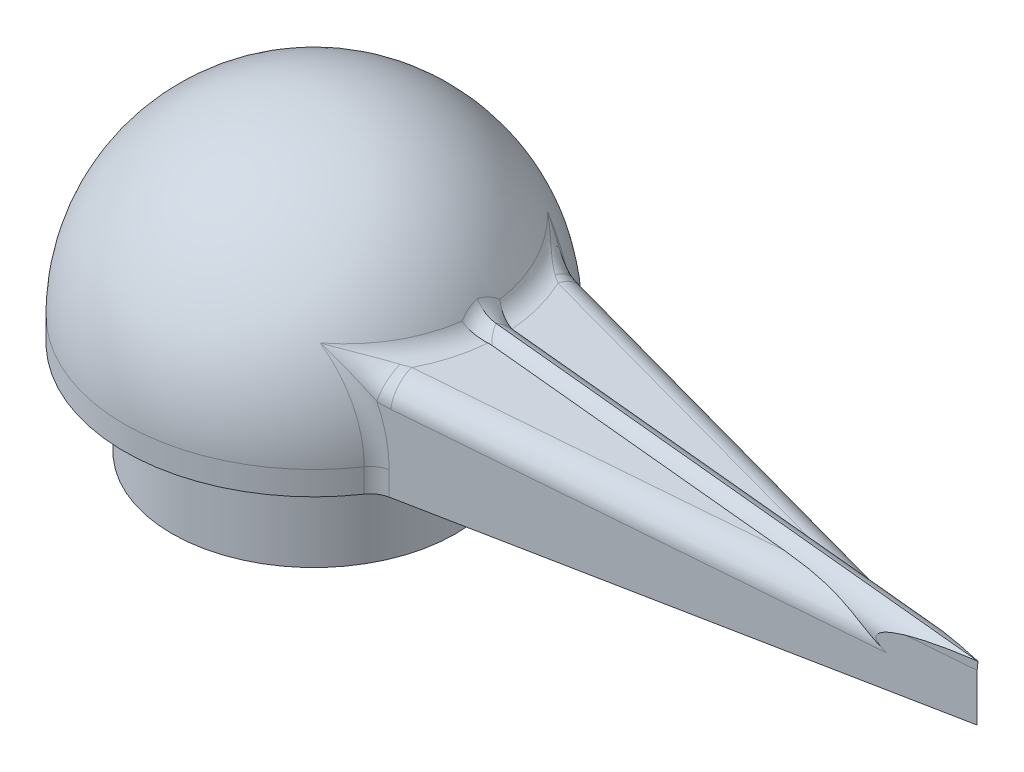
ISO-10303-21;
HEADER;
FILE_DESCRIPTION(('STEP AP214'),'2;1');
FILE_NAME('part.step','',(''),(''),'','','');
FILE_SCHEMA(('AUTOMOTIVE_DESIGN { 1 0 10303 214 1 1 1 1 }'));
ENDSEC;
DATA;
#1=APPLICATION_CONTEXT('core data for automotive mechanical design processes');
#2=APPLICATION_PROTOCOL_DEFINITION('international standard','automotive_design',2000,#1);
#3=PRODUCT_CONTEXT('',#1,'mechanical');
#4=PRODUCT('Part','Part','',(#3));
#5=PRODUCT_RELATED_PRODUCT_CATEGORY('part','',(#4));
#6=PRODUCT_DEFINITION_FORMATION('','',#4);
#7=PRODUCT_DEFINITION_CONTEXT('part definition',#1,'design');
#8=PRODUCT_DEFINITION('design','',#6,#7);
#9=PRODUCT_DEFINITION_SHAPE('','',#8);
#10=(LENGTH_UNIT() NAMED_UNIT(*) SI_UNIT(.MILLI.,.METRE.));
#11=(NAMED_UNIT(*) PLANE_ANGLE_UNIT() SI_UNIT($,.RADIAN.));
#12=(NAMED_UNIT(*) SI_UNIT($,.STERADIAN.) SOLID_ANGLE_UNIT());
#13=UNCERTAINTY_MEASURE_WITH_UNIT(LENGTH_MEASURE(1.E-05),#10,'distance_accuracy_value','');
#14=(GEOMETRIC_REPRESENTATION_CONTEXT(3) GLOBAL_UNCERTAINTY_ASSIGNED_CONTEXT((#13)) GLOBAL_UNIT_ASSIGNED_CONTEXT((#10,
#11,#12)) REPRESENTATION_CONTEXT('',''));
#15=CARTESIAN_POINT('',(0.,0.,0.));
#16=DIRECTION('',(0.,0.,1.));
#17=DIRECTION('',(1.,0.,0.));
#18=AXIS2_PLACEMENT_3D('',#15,#16,#17);
#19=CARTESIAN_POINT('',(0.,1.25,0.));
#20=DIRECTION('',(0.,0.,1.));
#21=DIRECTION('',(1.,0.,0.));
#22=AXIS2_PLACEMENT_3D('',#19,#20,#21);
#23=SPHERICAL_SURFACE('',#22,2.);
#24=CARTESIAN_POINT('',(0.,1.25,0.));
#25=DIRECTION('',(0.,1.,0.));
#26=DIRECTION('',(0.,0.,1.));
#27=AXIS2_PLACEMENT_3D('',#24,#25,#26);
#28=CIRCLE('',#27,2.);
#29=CARTESIAN_POINT('',(1.65447496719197,1.25,-1.12370484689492));
#30=VERTEX_POINT('',#29);
#31=CARTESIAN_POINT('',(1.65447496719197,1.25,1.12370484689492));
#32=VERTEX_POINT('',#31);
#33=EDGE_CURVE('E205',#30,#32,#28,.T.);
#34=ORIENTED_EDGE('',*,*,#33,.T.);
#35=CARTESIAN_POINT('',(0.273992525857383,1.25,1.39487104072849));
#36=DIRECTION('',(-0.192745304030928,0.,-0.981248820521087));
#37=DIRECTION('',(-0.981248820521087,0.,0.192745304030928));
#38=AXIS2_PLACEMENT_3D('',#35,#36,#37);
#39=CIRCLE('',#38,1.406862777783);
#40=CARTESIAN_POINT('',(1.26772302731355,2.22655551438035,1.19967397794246));
#41=VERTEX_POINT('',#40);
#42=EDGE_CURVE('E595',#32,#41,#39,.F.);
#43=ORIENTED_EDGE('',*,*,#42,.T.);
#44=CARTESIAN_POINT('',(0.117831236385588,2.34975820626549,0.));
#45=DIRECTION('',(-0.106533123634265,-0.994309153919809,0.));
#46=DIRECTION('',(0.994309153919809,-0.106533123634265,0.));
#47=AXIS2_PLACEMENT_3D('',#44,#45,#46);
#48=CIRCLE('',#47,1.66632760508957);
#49=CARTESIAN_POINT('',(1.76269859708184,2.17352241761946,0.200000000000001));
#50=VERTEX_POINT('',#49);
#51=EDGE_CURVE('E602',#41,#50,#48,.F.);
#52=ORIENTED_EDGE('',*,*,#51,.T.);
#53=CARTESIAN_POINT('',(1.91034049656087,2.14556504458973,-0.0622352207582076));
#54=CARTESIAN_POINT('',(1.78535806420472,2.15853393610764,-0.054026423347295));
#55=CARTESIAN_POINT('',(1.72172358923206,2.26672719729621,-0.0439737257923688));
#56=CARTESIAN_POINT('',(1.9134911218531,2.14395537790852,-0.0366171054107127));
#57=CARTESIAN_POINT('',(1.78772821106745,2.15594669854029,-0.0222761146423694));
#58=CARTESIAN_POINT('',(1.72440436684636,2.26417846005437,0.0015695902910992));
#59=CARTESIAN_POINT('',(1.91990967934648,2.13796021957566,-0.0116667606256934));
#60=CARTESIAN_POINT('',(1.79250432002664,2.14696178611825,0.0082613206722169));
#61=CARTESIAN_POINT('',(1.7296100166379,2.25418523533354,0.0459257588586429));
#62=CARTESIAN_POINT('',(1.93312885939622,2.12369670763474,0.0228524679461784));
#63=CARTESIAN_POINT('',(1.80201056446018,2.12661155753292,0.0492209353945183));
#64=CARTESIAN_POINT('',(1.74015074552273,2.23021645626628,0.107293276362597));
#65=CARTESIAN_POINT('',(1.93797286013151,2.11825845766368,0.0336394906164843));
#66=CARTESIAN_POINT('',(1.8054820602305,2.11889427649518,0.0618824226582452));
#67=CARTESIAN_POINT('',(1.74399334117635,2.2210594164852,0.126470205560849));
#68=CARTESIAN_POINT('',(1.94994456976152,2.10437508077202,0.0567979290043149));
#69=CARTESIAN_POINT('',(1.8139801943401,2.09941307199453,0.0885283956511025));
#70=CARTESIAN_POINT('',(1.75344841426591,2.19764513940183,0.16764076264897));
#71=CARTESIAN_POINT('',(1.95734126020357,2.0955208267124,0.0689215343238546));
#72=CARTESIAN_POINT('',(1.81918774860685,2.08709843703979,0.102076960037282));
#73=CARTESIAN_POINT('',(1.75926417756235,2.18269001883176,0.189193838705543));
#74=CARTESIAN_POINT('',(1.97332825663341,2.07583712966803,0.0914908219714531));
#75=CARTESIAN_POINT('',(1.83027743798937,2.06018094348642,0.126356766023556));
#76=CARTESIAN_POINT('',(1.77178276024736,2.14940064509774,0.229317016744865));
#77=CARTESIAN_POINT('',(1.98192260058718,2.06500096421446,0.101930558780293));
#78=CARTESIAN_POINT('',(1.83617850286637,2.04552327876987,0.137071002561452));
#79=CARTESIAN_POINT('',(1.77848857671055,2.131054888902,0.247876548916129));
#80=CARTESIAN_POINT('',(1.99992517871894,2.04177876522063,0.120852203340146));
#81=CARTESIAN_POINT('',(1.84832945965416,2.01471920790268,0.155340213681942));
#82=CARTESIAN_POINT('',(1.79248594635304,2.09170032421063,0.281515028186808));
#83=CARTESIAN_POINT('',(2.00933138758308,2.02939655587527,0.129338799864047));
#84=CARTESIAN_POINT('',(1.85459259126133,1.99853348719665,0.162880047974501));
#85=CARTESIAN_POINT('',(1.79977603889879,2.07069808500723,0.296602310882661));
#86=CARTESIAN_POINT('',(2.02862977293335,2.00348368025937,0.144212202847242));
#87=CARTESIAN_POINT('',(1.8671982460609,1.9654159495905,0.174745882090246));
#88=CARTESIAN_POINT('',(1.81468496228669,2.02670924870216,0.323043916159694));
#89=CARTESIAN_POINT('',(2.03851948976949,1.98995861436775,0.150608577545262));
#90=CARTESIAN_POINT('',(1.8735504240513,1.94845397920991,0.17905167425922));
#91=CARTESIAN_POINT('',(1.82230210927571,2.00373231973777,0.334415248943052));
#92=CARTESIAN_POINT('',(2.04852386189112,1.97601308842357,0.155913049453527));
#93=CARTESIAN_POINT('',(1.8797707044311,1.93158897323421,0.181699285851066));
#94=CARTESIAN_POINT('',(1.82998273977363,1.98002294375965,0.343845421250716));
#95=(BOUNDED_SURFACE() B_SPLINE_SURFACE(3,2,((#53,#54,#55),(#56,#57,#58),(#59,#60,#61),(#62,#63,
#64),(#65,#66,#67),(#68,#69,#70),(#71,#72,#73),(#74,#75,#76),(#77,#78,#79),(#80,#81,#82),(#83,
#84,#85),(#86,#87,#88),(#89,#90,#91),(#92,#93,#94)),.UNSPECIFIED.,.F.,.F.,
.F.) B_SPLINE_SURFACE_WITH_KNOTS((4,2,2,2,2,2,4),(3,3),(0.,0.152325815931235,0.224960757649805,
0.315163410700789,0.405677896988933,0.495972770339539,0.585848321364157),(0.,1.),
.UNSPECIFIED.) GEOMETRIC_REPRESENTATION_ITEM() RATIONAL_B_SPLINE_SURFACE(((1.,0.893106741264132,
1.),(1.,0.891613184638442,1.),(1.,0.888469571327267,1.),(1.,0.881745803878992,1.),(1.,
0.879254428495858,1.),(1.,0.873009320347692,1.),(1.,0.869096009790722,1.),(1.,0.860472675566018,
1.),(1.,0.8557599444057,1.),(1.,0.84567931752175,1.),(1.,0.840313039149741,1.),(1.,
0.829060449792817,1.),(1.,0.823176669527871,1.),(1.,0.817080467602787,1.))) REPRESENTATION_ITEM('') SURFACE());
#96=CARTESIAN_POINT('',(1.82998273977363,1.98002294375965,0.343845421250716));
#97=CARTESIAN_POINT('',(1.82230210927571,2.00373231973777,0.334415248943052));
#98=CARTESIAN_POINT('',(1.81468496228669,2.02670924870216,0.323043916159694));
#99=CARTESIAN_POINT('',(1.79977603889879,2.07069808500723,0.296602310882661));
#100=CARTESIAN_POINT('',(1.79248594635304,2.09170032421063,0.281515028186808));
#101=CARTESIAN_POINT('',(1.77848857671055,2.131054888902,0.247876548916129));
#102=CARTESIAN_POINT('',(1.77178276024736,2.14940064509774,0.229317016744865));
#103=CARTESIAN_POINT('',(1.75926417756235,2.18269001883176,0.189193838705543));
#104=CARTESIAN_POINT('',(1.75344841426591,2.19764513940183,0.16764076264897));
#105=CARTESIAN_POINT('',(1.74399334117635,2.2210594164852,0.126470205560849));
#106=CARTESIAN_POINT('',(1.74015074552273,2.23021645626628,0.107293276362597));
#107=CARTESIAN_POINT('',(1.7296100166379,2.25418523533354,0.045925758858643));
#108=CARTESIAN_POINT('',(1.72440436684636,2.26417846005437,0.00156959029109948));
#109=CARTESIAN_POINT('',(1.72172358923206,2.26672719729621,-0.0439737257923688));
#110=B_SPLINE_CURVE_WITH_KNOTS('',3,(#96,#97,#98,#99,#100,#101,#102,#103,#104,#105,#106,#107,
#108,#109),.UNSPECIFIED.,.F.,.F.,(4,2,2,2,2,2,4),(0.,0.089875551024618,0.180170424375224,
0.270684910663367,0.360887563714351,0.433522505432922,0.585848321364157),.UNSPECIFIED.);
#111=CARTESIAN_POINT('',(1.72513281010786,2.2618877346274,0.));
#112=VERTEX_POINT('',#111);
#113=EDGE_CURVE('E236',#50,#112,#110,.T.);
#114=ORIENTED_EDGE('',*,*,#113,.T.);
#115=CARTESIAN_POINT('',(2.04623533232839,1.97919758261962,-0.15467865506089));
#116=CARTESIAN_POINT('',(1.87833304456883,1.93547989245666,-0.181053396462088));
#117=CARTESIAN_POINT('',(1.82822524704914,1.98543665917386,-0.341650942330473));
#118=CARTESIAN_POINT('',(2.03523130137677,1.99449415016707,-0.148641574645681));
#119=CARTESIAN_POINT('',(1.87147338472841,1.95403853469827,-0.177861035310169));
#120=CARTESIAN_POINT('',(1.81977315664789,2.01144013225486,-0.330918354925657));
#121=CARTESIAN_POINT('',(2.0243891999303,2.0092506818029,-0.141305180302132));
#122=CARTESIAN_POINT('',(1.86447012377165,1.97266646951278,-0.172673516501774));
#123=CARTESIAN_POINT('',(1.81141578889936,2.03650423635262,-0.31787587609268));
#124=CARTESIAN_POINT('',(2.0033934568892,2.03725150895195,-0.124168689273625));
#125=CARTESIAN_POINT('',(1.85066797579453,2.00871386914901,-0.158390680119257));
#126=CARTESIAN_POINT('',(1.79517757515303,2.08402410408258,-0.287411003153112));
#127=CARTESIAN_POINT('',(1.99324066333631,2.05049395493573,-0.114365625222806));
#128=CARTESIAN_POINT('',(1.84385507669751,2.02617878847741,-0.149334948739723));
#129=CARTESIAN_POINT('',(1.78729731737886,2.10647667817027,-0.269983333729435));
#130=CARTESIAN_POINT('',(1.96979305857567,2.08037820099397,-0.0876303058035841));
#131=CARTESIAN_POINT('',(1.82794335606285,2.06606963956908,-0.122649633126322));
#132=CARTESIAN_POINT('',(1.76903227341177,2.15709498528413,-0.222453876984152));
#133=CARTESIAN_POINT('',(1.95707785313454,2.0959569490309,-0.0694581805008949));
#134=CARTESIAN_POINT('',(1.81904485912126,2.08760421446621,-0.102959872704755));
#135=CARTESIAN_POINT('',(1.7590684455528,2.18343614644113,-0.19014787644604));
#136=CARTESIAN_POINT('',(1.94016419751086,2.11577189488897,-0.0383030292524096));
#137=CARTESIAN_POINT('',(1.80705020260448,2.11537322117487,-0.0673337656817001));
#138=CARTESIAN_POINT('',(1.74572917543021,2.21687027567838,-0.134760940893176));
#139=CARTESIAN_POINT('',(1.93467947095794,2.12198327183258,-0.0265526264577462));
#140=CARTESIAN_POINT('',(1.80312476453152,2.1241742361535,-0.053603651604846));
#141=CARTESIAN_POINT('',(1.74138337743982,2.22733363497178,-0.113871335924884));
#142=CARTESIAN_POINT('',(1.92509448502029,2.13239823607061,-0.00215428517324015));
#143=CARTESIAN_POINT('',(1.79622375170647,2.13904158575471,-0.0246253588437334));
#144=CARTESIAN_POINT('',(1.73374733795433,2.24484156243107,-0.0704965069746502));
#145=CARTESIAN_POINT('',(1.9209942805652,2.13660174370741,0.0104936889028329));
#146=CARTESIAN_POINT('',(1.79323698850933,2.14513578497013,-0.00936028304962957));
#147=CARTESIAN_POINT('',(1.73045713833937,2.25188599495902,-0.0480112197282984));
#148=CARTESIAN_POINT('',(1.91439481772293,2.14279203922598,0.0363601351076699));
#149=CARTESIAN_POINT('',(1.7883991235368,2.15421764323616,0.0221407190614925));
#150=CARTESIAN_POINT('',(1.72510723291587,2.26220712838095,-0.00202642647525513));
#151=CARTESIAN_POINT('',(1.91189695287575,2.14477689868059,0.0495790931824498));
#152=CARTESIAN_POINT('',(1.78654023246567,2.15722265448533,0.038403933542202));
#153=CARTESIAN_POINT('',(1.72304859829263,2.2654805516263,0.0214739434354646));
#154=CARTESIAN_POINT('',(1.90861926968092,2.14643754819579,0.0762231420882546));
#155=CARTESIAN_POINT('',(1.78405321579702,2.15998222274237,0.0712630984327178));
#156=CARTESIAN_POINT('',(1.72025839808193,2.26810744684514,0.068841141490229));
#157=CARTESIAN_POINT('',(1.90784483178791,2.14610612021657,0.0896487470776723));
#158=CARTESIAN_POINT('',(1.78342432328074,2.15973501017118,0.087892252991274));
#159=CARTESIAN_POINT('',(1.71953098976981,2.26744866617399,0.0927088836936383));
#160=CARTESIAN_POINT('',(1.90799616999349,2.14456703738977,0.102957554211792));
#161=CARTESIAN_POINT('',(1.78347430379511,2.15775320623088,0.104331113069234));
#162=CARTESIAN_POINT('',(1.719522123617,2.26474229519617,0.116368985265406));
#163=(BOUNDED_SURFACE() B_SPLINE_SURFACE(3,2,((#115,#116,#117),(#118,#119,#120),(#121,#122,
#123),(#124,#125,#126),(#127,#128,#129),(#130,#131,#132),(#133,#134,#135),(#136,#137,#138),
(#139,#140,#141),(#142,#143,#144),(#145,#146,#147),(#148,#149,#150),(#151,#152,#153),(#154,#155,
#156),(#157,#158,#159),(#160,#161,#162)),.UNSPECIFIED.,.F.,.F.,
.F.) B_SPLINE_SURFACE_WITH_KNOTS((4,2,2,2,2,2,2,4),(3,3),(0.,0.098968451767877,0.19805653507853,
0.340683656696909,0.420585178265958,0.500489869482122,0.580463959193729,0.660687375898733),(0.,
1.),.UNSPECIFIED.) GEOMETRIC_REPRESENTATION_ITEM() RATIONAL_B_SPLINE_SURFACE(((1.,
0.818471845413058,1.),(1.,0.825154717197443,1.),(1.,0.831567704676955,1.),(1.,0.843719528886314,
1.),(1.,0.849457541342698,1.),(1.,0.862448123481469,1.),(1.,0.869258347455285,1.),(1.,
0.878122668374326,1.),(1.,0.880951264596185,1.),(1.,0.885836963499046,1.),(1.,0.887894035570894,
1.),(1.,0.89116351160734,1.),(1.,0.89237518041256,1.),(1.,0.893915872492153,1.),(1.,
0.894242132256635,1.),(1.,0.894104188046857,1.))) REPRESENTATION_ITEM('') SURFACE());
#164=CARTESIAN_POINT('',(1.719522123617,2.26474229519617,0.116368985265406));
#165=CARTESIAN_POINT('',(1.71953098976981,2.26744866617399,0.0927088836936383));
#166=CARTESIAN_POINT('',(1.72025839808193,2.26810744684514,0.068841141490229));
#167=CARTESIAN_POINT('',(1.72304859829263,2.2654805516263,0.0214739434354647));
#168=CARTESIAN_POINT('',(1.72510723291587,2.26220712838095,-0.00202642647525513));
#169=CARTESIAN_POINT('',(1.73045713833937,2.25188599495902,-0.0480112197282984));
#170=CARTESIAN_POINT('',(1.73374733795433,2.24484156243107,-0.0704965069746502));
#171=CARTESIAN_POINT('',(1.74138337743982,2.22733363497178,-0.113871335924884));
#172=CARTESIAN_POINT('',(1.74572917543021,2.21687027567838,-0.134760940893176));
#173=CARTESIAN_POINT('',(1.7590684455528,2.18343614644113,-0.19014787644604));
#174=CARTESIAN_POINT('',(1.76903227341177,2.15709498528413,-0.222453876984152));
#175=CARTESIAN_POINT('',(1.78729731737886,2.10647667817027,-0.269983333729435));
#176=CARTESIAN_POINT('',(1.79517757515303,2.08402410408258,-0.287411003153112));
#177=CARTESIAN_POINT('',(1.81141578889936,2.03650423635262,-0.31787587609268));
#178=CARTESIAN_POINT('',(1.81977315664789,2.01144013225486,-0.330918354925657));
#179=CARTESIAN_POINT('',(1.82822524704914,1.98543665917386,-0.341650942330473));
#180=B_SPLINE_CURVE_WITH_KNOTS('',3,(#164,#165,#166,#167,#168,#169,#170,#171,#172,#173,#174,
#175,#176,#177,#178,#179),.UNSPECIFIED.,.F.,.F.,(4,2,2,2,2,2,2,4),(0.,0.0802234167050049,
0.160197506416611,0.240102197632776,0.320003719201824,0.462630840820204,0.561718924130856,
0.660687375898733),.UNSPECIFIED.);
#181=CARTESIAN_POINT('',(1.76269859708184,2.17352241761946,-0.200000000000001));
#182=VERTEX_POINT('',#181);
#183=EDGE_CURVE('E243',#112,#182,#180,.T.);
#184=ORIENTED_EDGE('',*,*,#183,.T.);
#185=CARTESIAN_POINT('',(0.117831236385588,2.34975820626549,0.));
#186=DIRECTION('',(-0.106533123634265,-0.994309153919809,0.));
#187=DIRECTION('',(0.994309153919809,-0.106533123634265,0.));
#188=AXIS2_PLACEMENT_3D('',#185,#186,#187);
#189=CIRCLE('',#188,1.66632760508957);
#190=CARTESIAN_POINT('',(1.26772302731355,2.22655551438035,-1.19967397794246));
#191=VERTEX_POINT('',#190);
#192=EDGE_CURVE('E601',#182,#191,#189,.F.);
#193=ORIENTED_EDGE('',*,*,#192,.T.);
#194=CARTESIAN_POINT('',(0.273992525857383,1.25,-1.3948710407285));
#195=DIRECTION('',(-0.192745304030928,0.,0.981248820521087));
#196=DIRECTION('',(0.981248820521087,0.,0.192745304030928));
#197=AXIS2_PLACEMENT_3D('',#194,#195,#196);
#198=CIRCLE('',#197,1.406862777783);
#199=EDGE_CURVE('E567',#191,#30,#198,.F.);
#200=ORIENTED_EDGE('',*,*,#199,.T.);
#201=EDGE_LOOP('',(#34,#43,#52,#114,#184,#193,#200));
#202=FACE_BOUND('',#201,.T.);
#203=ADVANCED_FACE('F38',(#202),#23,.T.);
#204=CARTESIAN_POINT('',(0.,2.25,7.79482998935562));
#205=DIRECTION('',(-0.106533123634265,-0.994309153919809,0.));
#206=DIRECTION('',(0.994309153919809,-0.106533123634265,0.));
#207=AXIS2_PLACEMENT_3D('',#204,#205,#206);
#208=PLANE('',#207);
#209=DIRECTION('',(-0.994309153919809,0.106533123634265,0.));
#210=VECTOR('',#209,1.);
#211=CARTESIAN_POINT('',(6.36363636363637,1.56818181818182,-0.125));
#212=LINE('',#211,#210);
#213=CARTESIAN_POINT('',(5.09322118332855,1.70429773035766,-0.125));
#214=VERTEX_POINT('',#213);
#215=CARTESIAN_POINT('',(2.00488334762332,2.0351910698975,-0.125));
#216=VERTEX_POINT('',#215);
#217=EDGE_CURVE('E176',#214,#216,#212,.T.);
#218=ORIENTED_EDGE('',*,*,#217,.F.);
#219=DIRECTION('',(-0.975870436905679,0.104557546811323,-0.191688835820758));
#220=VECTOR('',#219,1.);
#221=CARTESIAN_POINT('',(1.60268732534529,2.07828350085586,-0.810640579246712));
#222=LINE('',#221,#220);
#223=CARTESIAN_POINT('',(1.80497371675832,2.05660995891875,-0.770905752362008));
#224=VERTEX_POINT('',#223);
#225=EDGE_CURVE('E500',#214,#224,#222,.T.);
#226=ORIENTED_EDGE('',*,*,#225,.T.);
#227=CARTESIAN_POINT('',(0.105926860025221,2.23865069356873,0.));
#228=DIRECTION('',(-0.106533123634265,-0.994309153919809,0.));
#229=DIRECTION('',(0.994309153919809,-0.106533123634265,0.));
#230=AXIS2_PLACEMENT_3D('',#227,#228,#229);
#231=CIRCLE('',#230,1.87461855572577);
#232=CARTESIAN_POINT('',(1.96550572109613,2.03941010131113,-0.128313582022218));
#233=VERTEX_POINT('',#232);
#234=EDGE_CURVE('E413',#224,#233,#231,.T.);
#235=ORIENTED_EDGE('',*,*,#234,.T.);
#236=CARTESIAN_POINT('',(1.96550572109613,2.03941010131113,-0.128313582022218));
#237=CARTESIAN_POINT('',(1.97202148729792,2.03871198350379,-0.12719408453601));
#238=CARTESIAN_POINT('',(1.97856084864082,2.03801133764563,-0.126358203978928));
#239=CARTESIAN_POINT('',(1.99168672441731,2.03660499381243,-0.125253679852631));
#240=CARTESIAN_POINT('',(1.99827323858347,2.03589929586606,-0.124985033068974));
#241=CARTESIAN_POINT('',(2.00488334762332,2.0351910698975,-0.125));
#242=B_SPLINE_CURVE_WITH_KNOTS('',3,(#236,#237,#238,#239,#240,#241),.UNSPECIFIED.,.F.,.F.,(4,2,
4),(0.,0.0198890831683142,0.0397780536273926),.UNSPECIFIED.);
#243=EDGE_CURVE('E411',#233,#216,#242,.T.);
#244=ORIENTED_EDGE('',*,*,#243,.T.);
#245=EDGE_LOOP('',(#218,#226,#235,#244));
#246=FACE_BOUND('',#245,.T.);
#247=ADVANCED_FACE('F256',(#246),#208,.F.);
#248=CARTESIAN_POINT('',(0.105926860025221,2.23865069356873,0.));
#249=DIRECTION('',(-0.106533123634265,-0.994309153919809,0.));
#250=DIRECTION('',(0.994309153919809,-0.106533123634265,0.));
#251=AXIS2_PLACEMENT_3D('',#248,#249,#250);
#252=CIRCLE('',#251,1.87461855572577);
#253=CARTESIAN_POINT('',(1.96550572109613,2.03941010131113,0.128313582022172));
#254=VERTEX_POINT('',#253);
#255=CARTESIAN_POINT('',(1.80497371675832,2.05660995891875,0.770905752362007));
#256=VERTEX_POINT('',#255);
#257=EDGE_CURVE('E416',#254,#256,#252,.T.);
#258=ORIENTED_EDGE('',*,*,#257,.T.);
#259=DIRECTION('',(-0.975870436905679,0.104557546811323,0.191688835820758));
#260=VECTOR('',#259,1.);
#261=CARTESIAN_POINT('',(6.3169554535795,1.57318334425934,-0.115376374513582));
#262=LINE('',#261,#260);
#263=CARTESIAN_POINT('',(5.09322118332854,1.70429773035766,0.125));
#264=VERTEX_POINT('',#263);
#265=EDGE_CURVE('E369',#256,#264,#262,.F.);
#266=ORIENTED_EDGE('',*,*,#265,.T.);
#267=DIRECTION('',(0.994309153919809,-0.106533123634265,0.));
#268=VECTOR('',#267,1.);
#269=CARTESIAN_POINT('',(0.,2.25,0.125));
#270=LINE('',#269,#268);
#271=CARTESIAN_POINT('',(2.00488334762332,2.0351910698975,0.125));
#272=VERTEX_POINT('',#271);
#273=EDGE_CURVE('E209',#272,#264,#270,.T.);
#274=ORIENTED_EDGE('',*,*,#273,.F.);
#275=CARTESIAN_POINT('',(2.00488334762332,2.0351910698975,0.125));
#276=CARTESIAN_POINT('',(1.99827278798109,2.03589934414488,0.124979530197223));
#277=CARTESIAN_POINT('',(1.99168605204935,2.03660506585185,0.125245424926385));
#278=CARTESIAN_POINT('',(1.97856017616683,2.03801140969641,0.126349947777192));
#279=CARTESIAN_POINT('',(1.9720210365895,2.03871203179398,0.127188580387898));
#280=CARTESIAN_POINT('',(1.96550572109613,2.03941010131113,0.128313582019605));
#281=B_SPLINE_CURVE_WITH_KNOTS('',3,(#275,#276,#277,#278,#279,#280),.UNSPECIFIED.,.F.,.F.,(4,2,
4),(0.,0.019889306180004,0.0397787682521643),.UNSPECIFIED.);
#282=EDGE_CURVE('E607',#272,#254,#281,.T.);
#283=ORIENTED_EDGE('',*,*,#282,.T.);
#284=EDGE_LOOP('',(#258,#266,#274,#283));
#285=FACE_BOUND('',#284,.T.);
#286=ADVANCED_FACE('F390',(#285),#208,.F.);
#287=CARTESIAN_POINT('',(0.,1.,0.));
#288=DIRECTION('',(0.,-1.,0.));
#289=DIRECTION('',(0.,0.,-1.));
#290=AXIS2_PLACEMENT_3D('',#287,#288,#289);
#291=CYLINDRICAL_SURFACE('',#290,1.5);
#292=CARTESIAN_POINT('',(0.,1.,0.));
#293=DIRECTION('',(0.,1.,0.));
#294=DIRECTION('',(0.,0.,1.));
#295=AXIS2_PLACEMENT_3D('',#292,#293,#294);
#296=CIRCLE('',#295,1.5);
#297=CARTESIAN_POINT('',(0.,1.,1.5));
#298=VERTEX_POINT('',#297);
#299=EDGE_CURVE('E206',#298,#298,#296,.T.);
#300=ORIENTED_EDGE('',*,*,#299,.F.);
#301=EDGE_LOOP('',(#300));
#302=FACE_BOUND('',#301,.T.);
#303=CARTESIAN_POINT('',(0.,0.,0.));
#304=DIRECTION('',(0.,1.,0.));
#305=DIRECTION('',(0.,0.,1.));
#306=AXIS2_PLACEMENT_3D('',#303,#304,#305);
#307=CIRCLE('',#306,1.5);
#308=CARTESIAN_POINT('',(0.,0.,1.5));
#309=VERTEX_POINT('',#308);
#310=EDGE_CURVE('E210',#309,#309,#307,.T.);
#311=ORIENTED_EDGE('',*,*,#310,.T.);
#312=EDGE_LOOP('',(#311));
#313=FACE_BOUND('',#312,.T.);
#314=ADVANCED_FACE('F258',(#302,#313),#291,.T.);
#315=CARTESIAN_POINT('',(0.,0.,0.));
#316=DIRECTION('',(0.,1.,0.));
#317=DIRECTION('',(0.,0.,1.));
#318=AXIS2_PLACEMENT_3D('',#315,#316,#317);
#319=PLANE('',#318);
#320=CARTESIAN_POINT('',(0.,0.,0.));
#321=DIRECTION('',(0.,-1.,0.));
#322=DIRECTION('',(0.,0.,-1.));
#323=AXIS2_PLACEMENT_3D('',#320,#321,#322);
#324=CIRCLE('',#323,0.999999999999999);
#325=CARTESIAN_POINT('',(0.,0.,-0.999999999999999));
#326=VERTEX_POINT('',#325);
#327=EDGE_CURVE('E395',#326,#326,#324,.T.);
#328=ORIENTED_EDGE('',*,*,#327,.F.);
#329=EDGE_LOOP('',(#328));
#330=FACE_BOUND('',#329,.T.);
#331=ORIENTED_EDGE('',*,*,#310,.F.);
#332=EDGE_LOOP('',(#331));
#333=FACE_BOUND('',#332,.T.);
#334=ADVANCED_FACE('F381',(#330,#333),#319,.F.);
#335=CARTESIAN_POINT('',(0.,1.,0.));
#336=DIRECTION('',(0.,1.,0.));
#337=DIRECTION('',(0.,0.,1.));
#338=AXIS2_PLACEMENT_3D('',#335,#336,#337);
#339=PLANE('',#338);
#340=ORIENTED_EDGE('',*,*,#299,.T.);
#341=EDGE_LOOP('',(#340));
#342=FACE_BOUND('',#341,.T.);
#343=CARTESIAN_POINT('',(0.,1.,0.));
#344=DIRECTION('',(0.,1.,0.));
#345=DIRECTION('',(0.,0.,1.));
#346=AXIS2_PLACEMENT_3D('',#343,#344,#345);
#347=CIRCLE('',#346,2.);
#348=CARTESIAN_POINT('',(1.65447496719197,1.,-1.12370484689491));
#349=VERTEX_POINT('',#348);
#350=CARTESIAN_POINT('',(1.65447496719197,1.,1.12370484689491));
#351=VERTEX_POINT('',#350);
#352=EDGE_CURVE('E194',#349,#351,#347,.T.);
#353=ORIENTED_EDGE('',*,*,#352,.F.);
#354=CARTESIAN_POINT('',(1.86128433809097,1.,-1.26416795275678));
#355=DIRECTION('',(0.,1.,0.));
#356=DIRECTION('',(0.,0.,1.));
#357=AXIS2_PLACEMENT_3D('',#354,#355,#356);
#358=CIRCLE('',#357,0.25);
#359=CARTESIAN_POINT('',(1.81309801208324,1.,-1.01885574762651));
#360=VERTEX_POINT('',#359);
#361=EDGE_CURVE('E540',#349,#360,#358,.T.);
#362=ORIENTED_EDGE('',*,*,#361,.T.);
#363=DIRECTION('',(0.981248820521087,0.,0.192745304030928));
#364=VECTOR('',#363,1.);
#365=CARTESIAN_POINT('',(7.,1.,0.));
#366=LINE('',#365,#364);
#367=CARTESIAN_POINT('',(7.,1.,0.));
#368=VERTEX_POINT('',#367);
#369=EDGE_CURVE('E198',#360,#368,#366,.T.);
#370=ORIENTED_EDGE('',*,*,#369,.T.);
#371=DIRECTION('',(-0.981248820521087,0.,0.192745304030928));
#372=VECTOR('',#371,1.);
#373=CARTESIAN_POINT('',(0.,1.,1.375));
#374=LINE('',#373,#372);
#375=CARTESIAN_POINT('',(1.81309801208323,1.,1.01885574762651));
#376=VERTEX_POINT('',#375);
#377=EDGE_CURVE('E193',#368,#376,#374,.T.);
#378=ORIENTED_EDGE('',*,*,#377,.T.);
#379=CARTESIAN_POINT('',(1.86128433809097,1.,1.26416795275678));
#380=DIRECTION('',(0.,1.,0.));
#381=DIRECTION('',(0.,0.,1.));
#382=AXIS2_PLACEMENT_3D('',#379,#380,#381);
#383=CIRCLE('',#382,0.25);
#384=EDGE_CURVE('E424',#376,#351,#383,.T.);
#385=ORIENTED_EDGE('',*,*,#384,.T.);
#386=EDGE_LOOP('',(#353,#362,#370,#378,#385));
#387=FACE_BOUND('',#386,.T.);
#388=ADVANCED_FACE('F377',(#342,#387),#339,.F.);
#389=CARTESIAN_POINT('',(0.,1.25,0.));
#390=DIRECTION('',(0.,-1.,0.));
#391=DIRECTION('',(0.,0.,-1.));
#392=AXIS2_PLACEMENT_3D('',#389,#390,#391);
#393=CYLINDRICAL_SURFACE('',#392,2.);
#394=ORIENTED_EDGE('',*,*,#352,.T.);
#395=DIRECTION('',(0.,-1.,0.));
#396=VECTOR('',#395,1.);
#397=CARTESIAN_POINT('',(1.65447496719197,1.25,1.12370484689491));
#398=LINE('',#397,#396);
#399=EDGE_CURVE('E225',#351,#32,#398,.F.);
#400=ORIENTED_EDGE('',*,*,#399,.T.);
#401=ORIENTED_EDGE('',*,*,#33,.F.);
#402=DIRECTION('',(0.,-1.,0.));
#403=VECTOR('',#402,1.);
#404=CARTESIAN_POINT('',(1.65447496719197,1.25,-1.12370484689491));
#405=LINE('',#404,#403);
#406=EDGE_CURVE('E219',#30,#349,#405,.T.);
#407=ORIENTED_EDGE('',*,*,#406,.T.);
#408=EDGE_LOOP('',(#394,#400,#401,#407));
#409=FACE_BOUND('',#408,.T.);
#410=ADVANCED_FACE('F374',(#409),#393,.T.);
#411=CARTESIAN_POINT('',(7.,1.5,0.));
#412=DIRECTION('',(0.192745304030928,0.,-0.981248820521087));
#413=DIRECTION('',(-0.981248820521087,0.,-0.192745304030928));
#414=AXIS2_PLACEMENT_3D('',#411,#412,#413);
#415=PLANE('',#414);
#416=CARTESIAN_POINT('',(0.260055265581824,1.25,-1.32391771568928));
#417=DIRECTION('',(0.192745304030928,0.,-0.981248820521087));
#418=DIRECTION('',(-0.981248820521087,0.,-0.192745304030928));
#419=AXIS2_PLACEMENT_3D('',#416,#417,#418);
#420=CIRCLE('',#419,1.58272062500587);
#421=CARTESIAN_POINT('',(1.81309801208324,1.25,-1.01885574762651));
#422=VERTEX_POINT('',#421);
#423=CARTESIAN_POINT('',(1.70444052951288,1.8316008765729,-1.04019918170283));
#424=VERTEX_POINT('',#423);
#425=EDGE_CURVE('E232',#422,#424,#420,.F.);
#426=ORIENTED_EDGE('',*,*,#425,.T.);
#427=CARTESIAN_POINT('',(2.07516762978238,1.82719329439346,-0.967377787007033));
#428=CARTESIAN_POINT('',(1.99601715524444,2.12194199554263,-0.982925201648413));
#429=CARTESIAN_POINT('',(1.95396538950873,2.06354692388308,-0.685931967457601));
#430=CARTESIAN_POINT('',(2.03462235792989,1.81586909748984,-0.975342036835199));
#431=CARTESIAN_POINT('',(1.97848709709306,2.10650359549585,-0.986368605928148));
#432=CARTESIAN_POINT('',(1.93044026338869,2.05823330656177,-0.698767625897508));
#433=CARTESIAN_POINT('',(1.99305329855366,1.80884363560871,-0.983507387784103));
#434=CARTESIAN_POINT('',(1.95686826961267,2.09213232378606,-0.990615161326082));
#435=CARTESIAN_POINT('',(1.90598691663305,2.05511366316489,-0.712422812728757));
#436=CARTESIAN_POINT('',(1.90968541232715,1.80274411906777,-0.999883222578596));
#437=CARTESIAN_POINT('',(1.90801163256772,2.06823042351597,-1.00021200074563));
#438=CARTESIAN_POINT('',(1.85609534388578,2.05294329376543,-0.740880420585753));
#439=CARTESIAN_POINT('',(1.86789144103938,1.80360383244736,-1.00809275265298));
#440=CARTESIAN_POINT('',(1.881099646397,2.05850600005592,-1.00549828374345));
#441=CARTESIAN_POINT('',(1.83066710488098,2.05385864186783,-0.755672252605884));
#442=CARTESIAN_POINT('',(1.80590903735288,1.81024017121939,-1.02026786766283));
#443=CARTESIAN_POINT('',(1.83740478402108,2.04827037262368,-1.01408120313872));
#444=CARTESIAN_POINT('',(1.79216715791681,2.05798131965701,-0.778498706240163));
#445=CARTESIAN_POINT('',(1.7853979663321,1.81333438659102,-1.02429682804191));
#446=CARTESIAN_POINT('',(1.82255713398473,2.04559316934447,-1.01699770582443));
#447=CARTESIAN_POINT('',(1.77929472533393,2.05980880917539,-0.786201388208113));
#448=CARTESIAN_POINT('',(1.74466762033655,1.82121536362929,-1.03229743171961));
#449=CARTESIAN_POINT('',(1.79213575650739,2.04173000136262,-1.02297333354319));
#450=CARTESIAN_POINT('',(1.75344747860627,2.06433666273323,-0.801797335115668));
#451=CARTESIAN_POINT('',(1.72444866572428,1.82600385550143,-1.03626901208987));
#452=CARTESIAN_POINT('',(1.77657517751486,2.04051760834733,-1.0260298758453));
#453=CARTESIAN_POINT('',(1.74047257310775,2.06703791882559,-0.809690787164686));
#454=CARTESIAN_POINT('',(1.66440558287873,1.84280014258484,-1.04806318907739));
#455=CARTESIAN_POINT('',(1.7295235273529,2.03921987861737,-1.03527216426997));
#456=CARTESIAN_POINT('',(1.70146724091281,2.07639861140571,-0.833599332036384));
#457=CARTESIAN_POINT('',(1.62521469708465,1.85723654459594,-1.05576139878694));
#458=CARTESIAN_POINT('',(1.69685398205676,2.04128624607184,-1.04168939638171));
#459=CARTESIAN_POINT('',(1.67536824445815,2.08431362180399,-0.849835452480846));
#460=CARTESIAN_POINT('',(1.54944802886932,1.89211762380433,-1.07064413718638));
#461=CARTESIAN_POINT('',(1.63129878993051,2.05175159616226,-1.05456630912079));
#462=CARTESIAN_POINT('',(1.62352470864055,2.10324989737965,-0.88241811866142));
#463=CARTESIAN_POINT('',(1.51287498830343,1.91256848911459,-1.07782812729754));
#464=CARTESIAN_POINT('',(1.59837829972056,2.05995208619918,-1.06103283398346));
#465=CARTESIAN_POINT('',(1.59778056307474,2.11427436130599,-0.898764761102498));
#466=CARTESIAN_POINT('',(1.47811632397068,1.93577793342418,-1.08465572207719));
#467=CARTESIAN_POINT('',(1.56555985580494,2.07153575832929,-1.06747931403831));
#468=CARTESIAN_POINT('',(1.57251029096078,2.12672454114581,-0.914909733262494));
#469=(BOUNDED_SURFACE() B_SPLINE_SURFACE(3,2,((#427,#428,#429),(#430,#431,#432),(#433,#434,
#435),(#436,#437,#438),(#439,#440,#441),(#442,#443,#444),(#445,#446,#447),(#448,#449,#450),
(#451,#452,#453),(#454,#455,#456),(#457,#458,#459),(#460,#461,#462),(#463,#464,#465),(#466,#467,
#468)),.UNSPECIFIED.,.F.,.F.,.F.) B_SPLINE_SURFACE_WITH_KNOTS((4,2,2,2,2,2,4),(3,3),(0.,
0.128144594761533,0.255213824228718,0.318549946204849,0.381950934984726,0.508812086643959,
0.635804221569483),(0.,1.),
.UNSPECIFIED.) GEOMETRIC_REPRESENTATION_ITEM() RATIONAL_B_SPLINE_SURFACE(((1.,0.633198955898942,
1.),(1.,0.645948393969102,1.),(1.,0.659262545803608,1.),(1.,0.686458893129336,1.),(1.,
0.700335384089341,1.),(1.,0.721304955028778,1.),(1.,0.728309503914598,1.),(1.,0.742346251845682,
1.),(1.,0.749378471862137,1.),(1.,0.770452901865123,1.),(1.,0.784466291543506,1.),(1.,
0.812009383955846,1.),(1.,0.825538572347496,1.),(1.,0.838607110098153,1.))) REPRESENTATION_ITEM('') SURFACE());
#470=CARTESIAN_POINT('',(1.47811632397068,1.93577793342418,-1.08465572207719));
#471=CARTESIAN_POINT('',(1.51287498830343,1.91256848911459,-1.07782812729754));
#472=CARTESIAN_POINT('',(1.54944802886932,1.89211762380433,-1.07064413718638));
#473=CARTESIAN_POINT('',(1.62521469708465,1.85723654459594,-1.05576139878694));
#474=CARTESIAN_POINT('',(1.66440558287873,1.84280014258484,-1.04806318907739));
#475=CARTESIAN_POINT('',(1.72444866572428,1.82600385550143,-1.03626901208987));
#476=CARTESIAN_POINT('',(1.74466762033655,1.82121536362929,-1.03229743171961));
#477=CARTESIAN_POINT('',(1.7853979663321,1.81333438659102,-1.02429682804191));
#478=CARTESIAN_POINT('',(1.80590903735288,1.81024017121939,-1.02026786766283));
#479=CARTESIAN_POINT('',(1.86789144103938,1.80360383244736,-1.00809275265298));
#480=CARTESIAN_POINT('',(1.90968541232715,1.80274411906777,-0.999883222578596));
#481=CARTESIAN_POINT('',(1.99305329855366,1.80884363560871,-0.983507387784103));
#482=CARTESIAN_POINT('',(2.03462235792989,1.81586909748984,-0.975342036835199));
#483=CARTESIAN_POINT('',(2.07516762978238,1.82719329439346,-0.967377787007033));
#484=B_SPLINE_CURVE_WITH_KNOTS('',3,(#470,#471,#472,#473,#474,#475,#476,#477,#478,#479,#480,
#481,#482,#483),.UNSPECIFIED.,.F.,.F.,(4,2,2,2,2,2,4),(0.,0.126992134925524,0.253853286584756,
0.317254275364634,0.380590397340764,0.507659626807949,0.635804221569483),.UNSPECIFIED.);
#485=CARTESIAN_POINT('',(1.82652676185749,1.8080326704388,-1.01621795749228));
#486=VERTEX_POINT('',#485);
#487=EDGE_CURVE('E364',#424,#486,#484,.T.);
#488=ORIENTED_EDGE('',*,*,#487,.T.);
#489=DIRECTION('',(-0.975870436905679,0.104557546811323,-0.191688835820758));
#490=VECTOR('',#489,1.);
#491=CARTESIAN_POINT('',(6.33850849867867,1.32460605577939,-0.12993583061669));
#492=LINE('',#491,#490);
#493=CARTESIAN_POINT('',(6.20428380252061,1.33898727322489,-0.156301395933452));
#494=VERTEX_POINT('',#493);
#495=EDGE_CURVE('E362',#486,#494,#492,.F.);
#496=ORIENTED_EDGE('',*,*,#495,.T.);
#497=CARTESIAN_POINT('',(7.38181818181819,1.30823239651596,0.0750000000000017));
#498=DIRECTION('',(0.192745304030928,0.,-0.981248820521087));
#499=DIRECTION('',(0.975451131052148,-0.108545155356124,0.191606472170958));
#500=AXIS2_PLACEMENT_3D('',#497,#498,#499);
#501=ELLIPSE('',#500,1.30447201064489,0.25);
#502=CARTESIAN_POINT('',(6.36363636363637,1.56818181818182,-0.125));
#503=VERTEX_POINT('',#502);
#504=EDGE_CURVE('E187',#494,#503,#501,.T.);
#505=ORIENTED_EDGE('',*,*,#504,.T.);
#506=DIRECTION('',(-0.975870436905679,0.104557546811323,-0.191688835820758));
#507=VECTOR('',#506,1.);
#508=CARTESIAN_POINT('',(-1.20091566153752,2.37866953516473,-1.61089414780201));
#509=LINE('',#508,#507);
#510=CARTESIAN_POINT('',(7.,1.5,0.));
#511=VERTEX_POINT('',#510);
#512=EDGE_CURVE('E169',#511,#503,#509,.T.);
#513=ORIENTED_EDGE('',*,*,#512,.F.);
#514=DIRECTION('',(0.,-1.,0.));
#515=VECTOR('',#514,1.);
#516=CARTESIAN_POINT('',(7.,1.5,0.));
#517=LINE('',#516,#515);
#518=EDGE_CURVE('E184',#511,#368,#517,.T.);
#519=ORIENTED_EDGE('',*,*,#518,.T.);
#520=ORIENTED_EDGE('',*,*,#369,.F.);
#521=DIRECTION('',(0.,-1.,0.));
#522=VECTOR('',#521,1.);
#523=CARTESIAN_POINT('',(1.81309801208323,1.5,-1.01885574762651));
#524=LINE('',#523,#522);
#525=EDGE_CURVE('E234',#360,#422,#524,.F.);
#526=ORIENTED_EDGE('',*,*,#525,.T.);
#527=EDGE_LOOP('',(#426,#488,#496,#505,#513,#519,#520,#526));
#528=FACE_BOUND('',#527,.T.);
#529=ADVANCED_FACE('F182',(#528),#415,.T.);
#530=CARTESIAN_POINT('',(0.,1.5,1.375));
#531=DIRECTION('',(0.192745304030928,0.,0.981248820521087));
#532=DIRECTION('',(0.981248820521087,0.,-0.192745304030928));
#533=AXIS2_PLACEMENT_3D('',#530,#531,#532);
#534=PLANE('',#533);
#535=DIRECTION('',(-0.975870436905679,0.104557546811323,0.191688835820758));
#536=VECTOR('',#535,1.);
#537=CARTESIAN_POINT('',(1.62424037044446,1.82970621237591,1.05595278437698));
#538=LINE('',#537,#536);
#539=CARTESIAN_POINT('',(6.2042838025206,1.33898727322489,0.156301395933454));
#540=VERTEX_POINT('',#539);
#541=CARTESIAN_POINT('',(1.82652676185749,1.8080326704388,1.01621795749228));
#542=VERTEX_POINT('',#541);
#543=EDGE_CURVE('E514',#540,#542,#538,.T.);
#544=ORIENTED_EDGE('',*,*,#543,.T.);
#545=CARTESIAN_POINT('',(1.47811632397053,1.93577793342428,1.08465572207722));
#546=CARTESIAN_POINT('',(1.56555985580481,2.07153575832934,1.06747931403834));
#547=CARTESIAN_POINT('',(1.57251029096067,2.12672454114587,0.914909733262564));
#548=CARTESIAN_POINT('',(1.51287498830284,1.91256848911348,1.07782812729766));
#549=CARTESIAN_POINT('',(1.59837829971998,2.05995208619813,1.06103283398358));
#550=CARTESIAN_POINT('',(1.59778056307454,2.11427436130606,0.898764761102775));
#551=CARTESIAN_POINT('',(1.54944802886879,1.89211762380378,1.07064413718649));
#552=CARTESIAN_POINT('',(1.63129878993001,2.05175159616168,1.05456630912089));
#553=CARTESIAN_POINT('',(1.62352470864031,2.10324989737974,0.882418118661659));
#554=CARTESIAN_POINT('',(1.62521469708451,1.85723654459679,1.05576139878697));
#555=CARTESIAN_POINT('',(1.69685398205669,2.04128624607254,1.04168939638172));
#556=CARTESIAN_POINT('',(1.67536824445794,2.08431362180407,0.849835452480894));
#557=CARTESIAN_POINT('',(1.6644055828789,1.84280014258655,1.04806318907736));
#558=CARTESIAN_POINT('',(1.72952352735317,2.03921987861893,1.03527216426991));
#559=CARTESIAN_POINT('',(1.70146724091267,2.07639861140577,0.833599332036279));
#560=CARTESIAN_POINT('',(1.72444866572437,1.82600385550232,1.03626901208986));
#561=CARTESIAN_POINT('',(1.77657517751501,2.04051760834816,1.02602987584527));
#562=CARTESIAN_POINT('',(1.74047257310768,2.06703791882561,0.809690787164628));
#563=CARTESIAN_POINT('',(1.74466762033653,1.82121536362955,1.03229743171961));
#564=CARTESIAN_POINT('',(1.7921357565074,2.04173000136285,1.02297333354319));
#565=CARTESIAN_POINT('',(1.75344747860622,2.06433666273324,0.801797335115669));
#566=CARTESIAN_POINT('',(1.78539796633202,1.81333438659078,1.02429682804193));
#567=CARTESIAN_POINT('',(1.82255713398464,2.04559316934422,1.01699770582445));
#568=CARTESIAN_POINT('',(1.77929472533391,2.05980880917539,0.786201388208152));
#569=CARTESIAN_POINT('',(1.80590903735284,1.81024017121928,1.02026786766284));
#570=CARTESIAN_POINT('',(1.83740478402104,2.04827037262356,1.01408120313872));
#571=CARTESIAN_POINT('',(1.7921671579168,2.05798131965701,0.778498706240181));
#572=CARTESIAN_POINT('',(1.86789144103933,1.80360383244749,1.00809275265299));
#573=CARTESIAN_POINT('',(1.88109964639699,2.05850600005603,1.00549828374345));
#574=CARTESIAN_POINT('',(1.83066710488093,2.05385864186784,0.755672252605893));
#575=CARTESIAN_POINT('',(1.90968541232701,1.80274411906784,0.999883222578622));
#576=CARTESIAN_POINT('',(1.90801163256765,2.068230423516,1.00021200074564));
#577=CARTESIAN_POINT('',(1.85609534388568,2.05294329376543,0.740880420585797));
#578=CARTESIAN_POINT('',(1.99305329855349,1.80884363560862,0.983507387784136));
#579=CARTESIAN_POINT('',(1.95686826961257,2.09213232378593,0.990615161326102));
#580=CARTESIAN_POINT('',(1.90598691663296,2.05511366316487,0.712422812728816));
#581=CARTESIAN_POINT('',(2.03462235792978,1.81586909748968,0.975342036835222));
#582=CARTESIAN_POINT('',(1.97848709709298,2.10650359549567,0.986368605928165));
#583=CARTESIAN_POINT('',(1.93044026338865,2.05823330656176,0.698767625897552));
#584=CARTESIAN_POINT('',(2.07516762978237,1.82719329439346,0.967377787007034));
#585=CARTESIAN_POINT('',(1.99601715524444,2.12194199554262,0.982925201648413));
#586=CARTESIAN_POINT('',(1.95396538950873,2.06354692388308,0.685931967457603));
#587=(BOUNDED_SURFACE() B_SPLINE_SURFACE(3,2,((#545,#546,#547),(#548,#549,#550),(#551,#552,
#553),(#554,#555,#556),(#557,#558,#559),(#560,#561,#562),(#563,#564,#565),(#566,#567,#568),
(#569,#570,#571),(#572,#573,#574),(#575,#576,#577),(#578,#579,#580),(#581,#582,#583),(#584,#585,
#586)),.UNSPECIFIED.,.F.,.F.,.F.) B_SPLINE_SURFACE_WITH_KNOTS((4,2,2,2,2,2,4),(3,3),(0.,
0.126992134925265,0.253853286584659,0.317254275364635,0.380590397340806,0.507659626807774,
0.635804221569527),(0.,1.),
.UNSPECIFIED.) GEOMETRIC_REPRESENTATION_ITEM() RATIONAL_B_SPLINE_SURFACE(((1.,0.83860711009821,
1.),(1.,0.825538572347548,1.),(1.,0.812009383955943,1.),(1.,0.784466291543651,1.),(1.,
0.770452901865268,1.),(1.,0.749378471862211,1.),(1.,0.742346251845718,1.),(1.,0.728309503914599,
1.),(1.,0.721304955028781,1.),(1.,0.700335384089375,1.),(1.,0.686458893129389,1.),(1.,
0.659262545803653,1.),(1.,0.64594839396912,1.),(1.,0.633198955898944,1.))) REPRESENTATION_ITEM('') SURFACE());
#588=CARTESIAN_POINT('',(2.07516762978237,1.82719329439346,0.967377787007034));
#589=CARTESIAN_POINT('',(2.03462235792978,1.81586909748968,0.975342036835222));
#590=CARTESIAN_POINT('',(1.99305329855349,1.80884363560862,0.983507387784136));
#591=CARTESIAN_POINT('',(1.90968541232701,1.80274411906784,0.999883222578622));
#592=CARTESIAN_POINT('',(1.86789144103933,1.80360383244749,1.00809275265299));
#593=CARTESIAN_POINT('',(1.80590903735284,1.81024017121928,1.02026786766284));
#594=CARTESIAN_POINT('',(1.78539796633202,1.81333438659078,1.02429682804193));
#595=CARTESIAN_POINT('',(1.74466762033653,1.82121536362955,1.03229743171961));
#596=CARTESIAN_POINT('',(1.72444866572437,1.82600385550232,1.03626901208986));
#597=CARTESIAN_POINT('',(1.6644055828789,1.84280014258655,1.04806318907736));
#598=CARTESIAN_POINT('',(1.62521469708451,1.85723654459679,1.05576139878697));
#599=CARTESIAN_POINT('',(1.54944802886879,1.89211762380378,1.07064413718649));
#600=CARTESIAN_POINT('',(1.51287498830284,1.91256848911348,1.07782812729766));
#601=CARTESIAN_POINT('',(1.47811632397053,1.93577793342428,1.08465572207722));
#602=B_SPLINE_CURVE_WITH_KNOTS('',3,(#588,#589,#590,#591,#592,#593,#594,#595,#596,#597,#598,
#599,#600,#601),.UNSPECIFIED.,.F.,.F.,(4,2,2,2,2,2,4),(0.,0.128144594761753,0.255213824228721,
0.318549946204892,0.381950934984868,0.508812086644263,0.635804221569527),.UNSPECIFIED.);
#603=CARTESIAN_POINT('',(1.70444052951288,1.8316008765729,1.04019918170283));
#604=VERTEX_POINT('',#603);
#605=EDGE_CURVE('E334',#542,#604,#602,.T.);
#606=ORIENTED_EDGE('',*,*,#605,.T.);
#607=CARTESIAN_POINT('',(0.260055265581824,1.25,1.32391771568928));
#608=DIRECTION('',(0.192745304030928,0.,0.981248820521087));
#609=DIRECTION('',(0.981248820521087,0.,-0.192745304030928));
#610=AXIS2_PLACEMENT_3D('',#607,#608,#609);
#611=CIRCLE('',#610,1.58272062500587);
#612=CARTESIAN_POINT('',(1.81309801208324,1.25,1.01885574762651));
#613=VERTEX_POINT('',#612);
#614=EDGE_CURVE('E228',#604,#613,#611,.F.);
#615=ORIENTED_EDGE('',*,*,#614,.T.);
#616=DIRECTION('',(0.,-1.,0.));
#617=VECTOR('',#616,1.);
#618=CARTESIAN_POINT('',(1.81309801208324,1.5,1.01885574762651));
#619=LINE('',#618,#617);
#620=EDGE_CURVE('E230',#613,#376,#619,.T.);
#621=ORIENTED_EDGE('',*,*,#620,.T.);
#622=ORIENTED_EDGE('',*,*,#377,.F.);
#623=ORIENTED_EDGE('',*,*,#518,.F.);
#624=DIRECTION('',(-0.975870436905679,0.104557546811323,0.191688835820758));
#625=VECTOR('',#624,1.);
#626=CARTESIAN_POINT('',(-1.20091566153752,2.37866953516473,1.61089414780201));
#627=LINE('',#626,#625);
#628=CARTESIAN_POINT('',(6.36363636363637,1.56818181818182,0.125));
#629=VERTEX_POINT('',#628);
#630=EDGE_CURVE('E188',#511,#629,#627,.T.);
#631=ORIENTED_EDGE('',*,*,#630,.T.);
#632=CARTESIAN_POINT('',(7.38181818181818,1.30823239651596,-0.0750000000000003));
#633=DIRECTION('',(0.192745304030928,0.,0.981248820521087));
#634=DIRECTION('',(-0.975451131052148,0.108545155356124,0.191606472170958));
#635=AXIS2_PLACEMENT_3D('',#632,#633,#634);
#636=ELLIPSE('',#635,1.30447201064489,0.25);
#637=EDGE_CURVE('E60',#629,#540,#636,.T.);
#638=ORIENTED_EDGE('',*,*,#637,.T.);
#639=EDGE_LOOP('',(#544,#606,#615,#621,#622,#623,#631,#638));
#640=FACE_BOUND('',#639,.T.);
#641=ADVANCED_FACE('F191',(#640),#534,.T.);
#642=CARTESIAN_POINT('',(6.37428967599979,1.6676127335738,0.125));
#643=DIRECTION('',(-0.190597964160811,0.0204212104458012,-0.981455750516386));
#644=DIRECTION('',(-0.981660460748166,0.,0.190637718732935));
#645=AXIS2_PLACEMENT_3D('',#642,#643,#644);
#646=PLANE('',#645);
#647=DIRECTION('',(-0.106533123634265,-0.994309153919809,0.));
#648=VECTOR('',#647,1.);
#649=CARTESIAN_POINT('',(7.01065331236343,1.59943091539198,0.));
#650=LINE('',#649,#648);
#651=CARTESIAN_POINT('',(7.00942656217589,1.58798124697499,0.));
#652=VERTEX_POINT('',#651);
#653=EDGE_CURVE('E166',#652,#511,#650,.T.);
#654=ORIENTED_EDGE('',*,*,#653,.F.);
#655=CARTESIAN_POINT('',(7.36583821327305,1.30994453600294,-0.0750000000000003));
#656=DIRECTION('',(-0.190597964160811,0.0204212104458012,-0.981455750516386));
#657=DIRECTION('',(-0.975870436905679,0.104557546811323,0.191688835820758));
#658=AXIS2_PLACEMENT_3D('',#655,#656,#657);
#659=ELLIPSE('',#658,1.30419697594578,0.25);
#660=EDGE_CURVE('E197',#652,#629,#659,.F.);
#661=ORIENTED_EDGE('',*,*,#660,.T.);
#662=ORIENTED_EDGE('',*,*,#630,.F.);
#663=EDGE_LOOP('',(#654,#661,#662));
#664=FACE_BOUND('',#663,.T.);
#665=ADVANCED_FACE('F196',(#664),#646,.F.);
#666=CARTESIAN_POINT('',(7.01065331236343,1.59943091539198,0.));
#667=DIRECTION('',(-0.190597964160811,0.0204212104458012,0.981455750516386));
#668=DIRECTION('',(0.981660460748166,0.,0.190637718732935));
#669=AXIS2_PLACEMENT_3D('',#666,#667,#668);
#670=PLANE('',#669);
#671=ORIENTED_EDGE('',*,*,#512,.T.);
#672=CARTESIAN_POINT('',(7.36583821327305,1.30994453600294,0.0750000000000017));
#673=DIRECTION('',(-0.190597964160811,0.0204212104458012,0.981455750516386));
#674=DIRECTION('',(0.975870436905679,-0.104557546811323,0.191688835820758));
#675=AXIS2_PLACEMENT_3D('',#672,#673,#674);
#676=ELLIPSE('',#675,1.30419697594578,0.25);
#677=EDGE_CURVE('E171',#503,#652,#676,.F.);
#678=ORIENTED_EDGE('',*,*,#677,.T.);
#679=ORIENTED_EDGE('',*,*,#653,.T.);
#680=EDGE_LOOP('',(#671,#678,#679));
#681=FACE_BOUND('',#680,.T.);
#682=ADVANCED_FACE('F168',(#681),#670,.F.);
#683=CARTESIAN_POINT('',(6.34765639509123,1.41903544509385,0.0750000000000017));
#684=DIRECTION('',(0.994309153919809,-0.106533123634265,0.));
#685=DIRECTION('',(0.106533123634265,0.994309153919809,0.));
#686=AXIS2_PLACEMENT_3D('',#683,#684,#685);
#687=CYLINDRICAL_SURFACE('',#686,0.25);
#688=ORIENTED_EDGE('',*,*,#677,.F.);
#689=ORIENTED_EDGE('',*,*,#504,.F.);
#690=CARTESIAN_POINT('',(6.20428380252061,1.33898727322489,-0.156301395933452));
#691=CARTESIAN_POINT('',(6.18820914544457,1.34844801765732,-0.15946876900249));
#692=CARTESIAN_POINT('',(6.1721750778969,1.35810574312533,-0.162246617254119));
#693=CARTESIAN_POINT('',(6.14010417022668,1.37760905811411,-0.166993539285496));
#694=CARTESIAN_POINT('',(6.12406733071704,1.38745462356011,-0.16896271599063));
#695=CARTESIAN_POINT('',(6.09193260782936,1.40711184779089,-0.172060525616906));
#696=CARTESIAN_POINT('',(6.07583489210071,1.41692353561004,-0.173190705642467));
#697=CARTESIAN_POINT('',(6.04347340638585,1.43632611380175,-0.17466366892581));
#698=CARTESIAN_POINT('',(6.02720964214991,1.44591701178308,-0.175006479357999));
#699=CARTESIAN_POINT('',(5.97863876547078,1.47374336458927,-0.174987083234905));
#700=CARTESIAN_POINT('',(5.94598894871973,1.49139345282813,-0.173625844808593));
#701=CARTESIAN_POINT('',(5.87958085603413,1.52415760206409,-0.169299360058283));
#702=CARTESIAN_POINT('',(5.84582337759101,1.53927344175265,-0.1663352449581));
#703=CARTESIAN_POINT('',(5.78358028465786,1.56427864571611,-0.160507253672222));
#704=CARTESIAN_POINT('',(5.75526574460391,1.5746180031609,-0.157725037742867));
#705=CARTESIAN_POINT('',(5.69807974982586,1.59365804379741,-0.152251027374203));
#706=CARTESIAN_POINT('',(5.66920816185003,1.60235832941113,-0.149559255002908));
#707=CARTESIAN_POINT('',(5.58178534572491,1.62643345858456,-0.142011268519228));
#708=CARTESIAN_POINT('',(5.52260841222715,1.63971297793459,-0.137703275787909));
#709=CARTESIAN_POINT('',(5.43239552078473,1.65708630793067,-0.132684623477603));
#710=CARTESIAN_POINT('',(5.4016295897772,1.66251170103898,-0.131242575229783));
#711=CARTESIAN_POINT('',(5.33994835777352,1.67259549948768,-0.128835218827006));
#712=CARTESIAN_POINT('',(5.30903304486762,1.67725384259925,-0.127869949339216));
#713=CARTESIAN_POINT('',(5.247332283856,1.68592524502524,-0.126377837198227));
#714=CARTESIAN_POINT('',(5.21654751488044,1.6899427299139,-0.125847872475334));
#715=CARTESIAN_POINT('',(5.1549220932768,1.69747292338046,-0.125159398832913));
#716=CARTESIAN_POINT('',(5.12408146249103,1.7009857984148,-0.125000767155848));
#717=CARTESIAN_POINT('',(5.09322118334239,1.70429773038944,-0.124999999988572));
#718=B_SPLINE_CURVE_WITH_KNOTS('',3,(#690,#691,#692,#693,#694,#695,#696,#697,#698,#699,#700,
#701,#702,#703,#704,#705,#706,#707,#708,#709,#710,#711,#712,#713,#714,#715,#716,#717),
.UNSPECIFIED.,.F.,.F.,(4,2,2,2,2,2,2,2,2,2,2,2,2,4),(0.,0.0567510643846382,0.11349490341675,
0.170133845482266,0.22677083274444,0.338040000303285,0.449230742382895,0.539990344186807,
0.630771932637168,0.812921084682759,0.906737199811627,1.00056092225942,1.09370570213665,
1.18681968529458),.UNSPECIFIED.);
#719=EDGE_CURVE('E11',#494,#214,#718,.T.);
#720=ORIENTED_EDGE('',*,*,#719,.T.);
#721=ORIENTED_EDGE('',*,*,#217,.T.);
#722=CARTESIAN_POINT('',(2.04623533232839,1.97919758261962,-0.15467865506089));
#723=CARTESIAN_POINT('',(2.03523130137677,1.99449415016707,-0.148641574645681));
#724=CARTESIAN_POINT('',(2.0243891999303,2.0092506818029,-0.141305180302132));
#725=CARTESIAN_POINT('',(2.0033934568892,2.03725150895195,-0.124168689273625));
#726=CARTESIAN_POINT('',(1.99324066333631,2.05049395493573,-0.114365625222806));
#727=CARTESIAN_POINT('',(1.96979305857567,2.08037820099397,-0.087630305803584));
#728=CARTESIAN_POINT('',(1.95707785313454,2.0959569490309,-0.0694581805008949));
#729=CARTESIAN_POINT('',(1.94016419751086,2.11577189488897,-0.0383030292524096));
#730=CARTESIAN_POINT('',(1.93467947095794,2.12198327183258,-0.0265526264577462));
#731=CARTESIAN_POINT('',(1.92509448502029,2.13239823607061,-0.00215428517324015));
#732=CARTESIAN_POINT('',(1.9209942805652,2.13660174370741,0.0104936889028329));
#733=CARTESIAN_POINT('',(1.91439481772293,2.14279203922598,0.0363601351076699));
#734=CARTESIAN_POINT('',(1.91189695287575,2.14477689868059,0.0495790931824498));
#735=CARTESIAN_POINT('',(1.90861926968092,2.14643754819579,0.0762231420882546));
#736=CARTESIAN_POINT('',(1.90784483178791,2.14610612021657,0.0896487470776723));
#737=CARTESIAN_POINT('',(1.90799616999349,2.14456703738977,0.102957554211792));
#738=B_SPLINE_CURVE_WITH_KNOTS('',3,(#722,#723,#724,#725,#726,#727,#728,#729,#730,#731,#732,
#733,#734,#735,#736,#737),.UNSPECIFIED.,.F.,.F.,(4,2,2,2,2,2,2,4),(0.,0.098968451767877,
0.19805653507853,0.340683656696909,0.420585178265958,0.500489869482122,0.580463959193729,
0.660687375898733),.UNSPECIFIED.);
#739=CARTESIAN_POINT('',(1.92464024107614,2.13277978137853,0.));
#740=VERTEX_POINT('',#739);
#741=EDGE_CURVE('E407',#216,#740,#738,.T.);
#742=ORIENTED_EDGE('',*,*,#741,.T.);
#743=DIRECTION('',(0.994309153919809,-0.106533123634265,0.));
#744=VECTOR('',#743,1.);
#745=CARTESIAN_POINT('',(4.39837241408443,1.86773704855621,0.));
#746=LINE('',#745,#744);
#747=EDGE_CURVE('E220',#652,#740,#746,.F.);
#748=ORIENTED_EDGE('',*,*,#747,.F.);
#749=EDGE_LOOP('',(#688,#689,#720,#721,#742,#748));
#750=FACE_BOUND('',#749,.T.);
#751=ADVANCED_FACE('F285',(#750),#687,.T.);
#752=CARTESIAN_POINT('',(0.222355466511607,2.07531768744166,-0.0750000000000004));
#753=DIRECTION('',(-0.994309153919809,0.106533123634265,0.));
#754=DIRECTION('',(-0.106533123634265,-0.994309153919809,0.));
#755=AXIS2_PLACEMENT_3D('',#752,#753,#754);
#756=CYLINDRICAL_SURFACE('',#755,0.25);
#757=ORIENTED_EDGE('',*,*,#747,.T.);
#758=CARTESIAN_POINT('',(1.91034049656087,2.14556504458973,-0.0622352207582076));
#759=CARTESIAN_POINT('',(1.9134911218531,2.14395537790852,-0.0366171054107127));
#760=CARTESIAN_POINT('',(1.91990967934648,2.13796021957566,-0.0116667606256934));
#761=CARTESIAN_POINT('',(1.93312885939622,2.12369670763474,0.0228524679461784));
#762=CARTESIAN_POINT('',(1.93797286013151,2.11825845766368,0.0336394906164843));
#763=CARTESIAN_POINT('',(1.94994456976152,2.10437508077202,0.0567979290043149));
#764=CARTESIAN_POINT('',(1.95734126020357,2.0955208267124,0.0689215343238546));
#765=CARTESIAN_POINT('',(1.97332825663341,2.07583712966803,0.0914908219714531));
#766=CARTESIAN_POINT('',(1.98192260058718,2.06500096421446,0.101930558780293));
#767=CARTESIAN_POINT('',(1.99992517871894,2.04177876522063,0.120852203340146));
#768=CARTESIAN_POINT('',(2.00933138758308,2.02939655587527,0.129338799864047));
#769=CARTESIAN_POINT('',(2.02862977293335,2.00348368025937,0.144212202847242));
#770=CARTESIAN_POINT('',(2.03851948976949,1.98995861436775,0.150608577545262));
#771=CARTESIAN_POINT('',(2.04852386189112,1.97601308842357,0.155913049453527));
#772=B_SPLINE_CURVE_WITH_KNOTS('',3,(#758,#759,#760,#761,#762,#763,#764,#765,#766,#767,#768,
#769,#770,#771),.UNSPECIFIED.,.F.,.F.,(4,2,2,2,2,2,4),(0.,0.152325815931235,0.224960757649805,
0.315163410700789,0.405677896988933,0.495972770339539,0.585848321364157),.UNSPECIFIED.);
#773=EDGE_CURVE('E422',#740,#272,#772,.T.);
#774=ORIENTED_EDGE('',*,*,#773,.T.);
#775=ORIENTED_EDGE('',*,*,#273,.T.);
#776=CARTESIAN_POINT('',(5.09322118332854,1.70429773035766,0.125));
#777=CARTESIAN_POINT('',(5.13470439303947,1.69983300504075,0.125000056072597));
#778=CARTESIAN_POINT('',(5.17615981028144,1.69502348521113,0.125287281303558));
#779=CARTESIAN_POINT('',(5.25897434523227,1.68442449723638,0.126566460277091));
#780=CARTESIAN_POINT('',(5.30033332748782,1.67863406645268,0.127559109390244));
#781=CARTESIAN_POINT('',(5.3829027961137,1.66577957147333,0.130382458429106));
#782=CARTESIAN_POINT('',(5.42411290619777,1.65871334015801,0.132214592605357));
#783=CARTESIAN_POINT('',(5.5061496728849,1.64284885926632,0.13679698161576));
#784=CARTESIAN_POINT('',(5.54697637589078,1.63405082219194,0.139547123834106));
#785=CARTESIAN_POINT('',(5.62864747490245,1.61393854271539,0.145926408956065));
#786=CARTESIAN_POINT('',(5.66948168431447,1.60258626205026,0.149568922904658));
#787=CARTESIAN_POINT('',(5.75010664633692,1.57672140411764,0.157195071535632));
#788=CARTESIAN_POINT('',(5.78989776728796,1.56220995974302,0.161178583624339));
#789=CARTESIAN_POINT('',(5.86782267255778,1.5297073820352,0.168273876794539));
#790=CARTESIAN_POINT('',(5.90596553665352,1.51173944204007,0.171391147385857));
#791=CARTESIAN_POINT('',(5.98079291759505,1.47278580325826,0.175058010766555));
#792=CARTESIAN_POINT('',(6.01747810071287,1.45180150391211,0.17560879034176));
#793=CARTESIAN_POINT('',(6.07897463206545,1.41510496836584,0.17318355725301));
#794=CARTESIAN_POINT('',(6.10402317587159,1.39971648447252,0.1712232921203));
#795=CARTESIAN_POINT('',(6.14155623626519,1.37674064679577,0.166753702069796));
#796=CARTESIAN_POINT('',(6.15409033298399,1.3690817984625,0.165002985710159));
#797=CARTESIAN_POINT('',(6.17916918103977,1.35390498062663,0.16101281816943));
#798=CARTESIAN_POINT('',(6.19171393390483,1.34638703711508,0.158773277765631));
#799=CARTESIAN_POINT('',(6.2042838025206,1.33898727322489,0.156301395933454));
#800=B_SPLINE_CURVE_WITH_KNOTS('',3,(#776,#777,#778,#779,#780,#781,#782,#783,#784,#785,#786,
#787,#788,#789,#790,#791,#792,#793,#794,#795,#796,#797,#798,#799),.UNSPECIFIED.,.F.,.F.,(4,2,2,
2,2,2,2,2,2,2,2,4),(0.,0.12517986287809,0.250483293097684,0.376001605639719,0.501504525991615,
0.629017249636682,0.756484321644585,0.88312416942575,1.00970545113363,1.09802393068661,
1.14239430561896,1.18677278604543),.UNSPECIFIED.);
#801=EDGE_CURVE('E52',#264,#540,#800,.T.);
#802=ORIENTED_EDGE('',*,*,#801,.T.);
#803=ORIENTED_EDGE('',*,*,#637,.F.);
#804=ORIENTED_EDGE('',*,*,#660,.F.);
#805=EDGE_LOOP('',(#757,#774,#775,#802,#803,#804));
#806=FACE_BOUND('',#805,.T.);
#807=ADVANCED_FACE('F260',(#806),#756,.T.);
#808=CARTESIAN_POINT('',(1.86128433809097,1.25,-1.26416795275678));
#809=DIRECTION('',(0.,-1.,0.));
#810=DIRECTION('',(0.,0.,-1.));
#811=AXIS2_PLACEMENT_3D('',#808,#809,#810);
#812=CYLINDRICAL_SURFACE('',#811,0.25);
#813=ORIENTED_EDGE('',*,*,#361,.F.);
#814=ORIENTED_EDGE('',*,*,#406,.F.);
#815=CARTESIAN_POINT('',(1.86128433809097,1.25,-1.26416795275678));
#816=DIRECTION('',(0.,-1.,0.));
#817=DIRECTION('',(0.,0.,-1.));
#818=AXIS2_PLACEMENT_3D('',#815,#816,#817);
#819=CIRCLE('',#818,0.25);
#820=EDGE_CURVE('E223',#422,#30,#819,.T.);
#821=ORIENTED_EDGE('',*,*,#820,.F.);
#822=ORIENTED_EDGE('',*,*,#525,.F.);
#823=EDGE_LOOP('',(#813,#814,#821,#822));
#824=FACE_BOUND('',#823,.T.);
#825=ADVANCED_FACE('F529',(#824),#812,.F.);
#826=CARTESIAN_POINT('',(0.308241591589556,1.25,-1.56922992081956));
#827=DIRECTION('',(0.192745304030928,0.,-0.981248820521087));
#828=DIRECTION('',(-0.981248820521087,0.,-0.192745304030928));
#829=AXIS2_PLACEMENT_3D('',#826,#827,#828);
#830=TOROIDAL_SURFACE('',#829,1.58272062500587,0.25);
#831=ORIENTED_EDGE('',*,*,#199,.F.);
#832=CARTESIAN_POINT('',(1.7827782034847,1.78788277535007,-1.03185867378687));
#833=CARTESIAN_POINT('',(1.80358672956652,2.06025250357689,-1.05338797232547));
#834=CARTESIAN_POINT('',(1.8096290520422,2.05623321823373,-0.779473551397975));
#835=CARTESIAN_POINT('',(1.76993918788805,1.79275686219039,-1.03185916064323));
#836=CARTESIAN_POINT('',(1.80213535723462,2.0557686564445,-1.04873867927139));
#837=CARTESIAN_POINT('',(1.79629868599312,2.05733052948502,-0.783285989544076));
#838=CARTESIAN_POINT('',(1.75691703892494,1.7990312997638,-1.03265005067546));
#839=CARTESIAN_POINT('',(1.79730739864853,2.05138815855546,-1.04385626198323));
#840=CARTESIAN_POINT('',(1.78269817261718,2.05914210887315,-0.788570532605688));
#841=CARTESIAN_POINT('',(1.7307671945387,1.81379436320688,-1.03553202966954));
#842=CARTESIAN_POINT('',(1.78235903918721,2.04432922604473,-1.03536166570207));
#843=CARTESIAN_POINT('',(1.75526237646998,2.06388790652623,-0.801494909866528));
#844=CARTESIAN_POINT('',(1.71764259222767,1.82225579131,-1.03760755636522));
#845=CARTESIAN_POINT('',(1.77253289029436,2.04158558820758,-1.03170882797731));
#846=CARTESIAN_POINT('',(1.74143180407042,2.06680852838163,-0.809106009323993));
#847=CARTESIAN_POINT('',(1.67993029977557,1.84895045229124,-1.04501065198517));
#848=CARTESIAN_POINT('',(1.73964382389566,2.0374263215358,-1.02469995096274));
#849=CARTESIAN_POINT('',(1.70156309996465,2.07637410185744,-0.833534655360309));
#850=CARTESIAN_POINT('',(1.65515308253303,1.86934578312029,-1.0516009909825));
#851=CARTESIAN_POINT('',(1.71212009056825,2.03858400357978,-1.0236516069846));
#852=CARTESIAN_POINT('',(1.67521571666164,2.08406633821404,-0.852653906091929));
#853=CARTESIAN_POINT('',(1.60469224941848,1.91402652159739,-1.06718171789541));
#854=CARTESIAN_POINT('',(1.6526105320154,2.04872901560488,-1.02968370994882));
#855=CARTESIAN_POINT('',(1.6214729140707,2.1012385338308,-0.895049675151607));
#856=CARTESIAN_POINT('',(1.57900258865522,1.93834448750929,-1.07619265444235));
#857=CARTESIAN_POINT('',(1.6205177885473,2.05738566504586,-1.03639610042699));
#858=CARTESIAN_POINT('',(1.59407032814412,2.11073358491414,-0.918361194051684));
#859=CARTESIAN_POINT('',(1.51049222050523,2.00441392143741,-1.10172347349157));
#860=CARTESIAN_POINT('',(1.53751944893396,2.08611859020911,-1.06105496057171));
#861=CARTESIAN_POINT('',(1.52116331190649,2.13672110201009,-0.982056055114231));
#862=CARTESIAN_POINT('',(1.4666411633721,2.04787102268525,-1.11950478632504));
#863=CARTESIAN_POINT('',(1.48379473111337,2.11034783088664,-1.0834937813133));
#864=CARTESIAN_POINT('',(1.47466270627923,2.15399379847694,-1.02429034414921));
#865=CARTESIAN_POINT('',(1.37345334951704,2.1358214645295,-1.15740931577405));
#866=CARTESIAN_POINT('',(1.37844888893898,2.16388467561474,-1.13554917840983));
#867=CARTESIAN_POINT('',(1.37688275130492,2.18933438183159,-1.11021774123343));
#868=CARTESIAN_POINT('',(1.32412860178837,2.18031237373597,-1.17752740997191));
#869=CARTESIAN_POINT('',(1.32498956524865,2.19392121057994,-1.16579973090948));
#870=CARTESIAN_POINT('',(1.325613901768,2.20740047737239,-1.15390751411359));
#871=CARTESIAN_POINT('',(1.27006202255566,2.22464361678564,-1.19875667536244));
#872=CARTESIAN_POINT('',(1.27009334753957,2.22520417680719,-1.1982700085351));
#873=CARTESIAN_POINT('',(1.27012271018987,2.22576305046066,-1.19778130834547));
#874=CARTESIAN_POINT('',(1.26889339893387,2.22559984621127,-1.19921517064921));
#875=CARTESIAN_POINT('',(1.26890842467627,2.22587961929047,-1.19897153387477));
#876=CARTESIAN_POINT('',(1.26892360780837,2.22615930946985,-1.19872783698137));
#877=CARTESIAN_POINT('',(1.26772302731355,2.22655551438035,-1.19967397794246));
#878=CARTESIAN_POINT('',(1.26772302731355,2.22655551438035,-1.19967397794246));
#879=CARTESIAN_POINT('',(1.26772302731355,2.22655551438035,-1.19967397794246));
#880=(BOUNDED_SURFACE() B_SPLINE_SURFACE(3,2,((#832,#833,#834),(#835,#836,#837),(#838,#839,
#840),(#841,#842,#843),(#844,#845,#846),(#847,#848,#849),(#850,#851,#852),(#853,#854,#855),
(#856,#857,#858),(#859,#860,#861),(#862,#863,#864),(#865,#866,#867),(#868,#869,#870),(#871,#872,
#873),(#874,#875,#876),(#877,#878,#879)),.UNSPECIFIED.,.F.,.F.,
.F.) B_SPLINE_SURFACE_WITH_KNOTS((4,2,2,2,2,2,2,4),(3,3),(0.,0.0688769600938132,
0.136935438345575,0.263289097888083,0.390751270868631,0.594690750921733,0.798191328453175,
0.802680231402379),(0.,1.),
.UNSPECIFIED.) GEOMETRIC_REPRESENTATION_ITEM() RATIONAL_B_SPLINE_SURFACE(((1.,0.673999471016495,
1.),(1.,0.685852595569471,1.),(1.,0.699164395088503,1.),(1.,0.727115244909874,1.),(1.,
0.741736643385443,1.),(1.,0.783626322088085,1.),(1.,0.810999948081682,1.),(1.,0.861594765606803,
1.),(1.,0.884777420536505,1.),(1.,0.936962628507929,1.),(1.,0.961111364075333,1.),(1.,
0.992455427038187,1.),(1.,0.999687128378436,1.),(1.,0.999996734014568,1.),(1.,1.00000004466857,
1.),(1.,1.,1.))) REPRESENTATION_ITEM('') SURFACE());
#881=CARTESIAN_POINT('',(1.7827782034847,1.78788277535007,-1.03185867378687));
#882=CARTESIAN_POINT('',(1.76993918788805,1.79275686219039,-1.03185916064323));
#883=CARTESIAN_POINT('',(1.75691703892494,1.7990312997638,-1.03265005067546));
#884=CARTESIAN_POINT('',(1.7307671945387,1.81379436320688,-1.03553202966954));
#885=CARTESIAN_POINT('',(1.71764259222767,1.82225579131,-1.03760755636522));
#886=CARTESIAN_POINT('',(1.67993029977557,1.84895045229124,-1.04501065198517));
#887=CARTESIAN_POINT('',(1.65515308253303,1.86934578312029,-1.0516009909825));
#888=CARTESIAN_POINT('',(1.60469224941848,1.91402652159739,-1.06718171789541));
#889=CARTESIAN_POINT('',(1.57900258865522,1.93834448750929,-1.07619265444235));
#890=CARTESIAN_POINT('',(1.51049222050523,2.00441392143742,-1.10172347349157));
#891=CARTESIAN_POINT('',(1.4666411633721,2.04787102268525,-1.11950478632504));
#892=CARTESIAN_POINT('',(1.37345334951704,2.1358214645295,-1.15740931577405));
#893=CARTESIAN_POINT('',(1.32412860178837,2.18031237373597,-1.17752740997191));
#894=CARTESIAN_POINT('',(1.27006202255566,2.22464361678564,-1.19875667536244));
#895=CARTESIAN_POINT('',(1.26889339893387,2.22559984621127,-1.19921517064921));
#896=CARTESIAN_POINT('',(1.26772302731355,2.22655551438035,-1.19967397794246));
#897=B_SPLINE_CURVE_WITH_KNOTS('',3,(#881,#882,#883,#884,#885,#886,#887,#888,#889,#890,#891,
#892,#893,#894,#895,#896),.UNSPECIFIED.,.F.,.F.,(4,2,2,2,2,2,2,4),(0.,0.0688769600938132,
0.136935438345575,0.263289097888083,0.390751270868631,0.594690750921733,0.798191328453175,
0.802680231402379),.UNSPECIFIED.);
#898=EDGE_CURVE('E356',#191,#424,#897,.F.);
#899=ORIENTED_EDGE('',*,*,#898,.T.);
#900=ORIENTED_EDGE('',*,*,#425,.F.);
#901=ORIENTED_EDGE('',*,*,#820,.T.);
#902=EDGE_LOOP('',(#831,#899,#900,#901));
#903=FACE_BOUND('',#902,.T.);
#904=ADVANCED_FACE('F306',(#903),#830,.F.);
#905=CARTESIAN_POINT('',(0.132560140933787,2.48722798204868,0.));
#906=DIRECTION('',(-0.106533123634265,-0.994309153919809,0.));
#907=DIRECTION('',(0.994309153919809,-0.106533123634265,0.));
#908=AXIS2_PLACEMENT_3D('',#905,#906,#907);
#909=TOROIDAL_SURFACE('',#908,1.87461855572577,0.25);
#910=CARTESIAN_POINT('',(1.95396538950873,2.06354692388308,-0.685931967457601));
#911=CARTESIAN_POINT('',(1.93044026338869,2.05823330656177,-0.698767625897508));
#912=CARTESIAN_POINT('',(1.90598691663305,2.05511366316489,-0.712422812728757));
#913=CARTESIAN_POINT('',(1.85609534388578,2.05294329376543,-0.740880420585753));
#914=CARTESIAN_POINT('',(1.83066710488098,2.05385864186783,-0.755672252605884));
#915=CARTESIAN_POINT('',(1.79216715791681,2.05798131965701,-0.778498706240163));
#916=CARTESIAN_POINT('',(1.77929472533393,2.05980880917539,-0.786201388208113));
#917=CARTESIAN_POINT('',(1.75344747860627,2.06433666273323,-0.801797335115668));
#918=CARTESIAN_POINT('',(1.74047257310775,2.06703791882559,-0.809690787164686));
#919=CARTESIAN_POINT('',(1.70146724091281,2.07639861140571,-0.833599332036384));
#920=CARTESIAN_POINT('',(1.67536824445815,2.08431362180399,-0.849835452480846));
#921=CARTESIAN_POINT('',(1.62352470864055,2.10324989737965,-0.88241811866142));
#922=CARTESIAN_POINT('',(1.59778056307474,2.11427436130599,-0.898764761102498));
#923=CARTESIAN_POINT('',(1.57251029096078,2.12672454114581,-0.914909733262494));
#924=B_SPLINE_CURVE_WITH_KNOTS('',3,(#910,#911,#912,#913,#914,#915,#916,#917,#918,#919,#920,
#921,#922,#923),.UNSPECIFIED.,.F.,.F.,(4,2,2,2,2,2,4),(0.,0.128144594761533,0.255213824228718,
0.318549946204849,0.381950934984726,0.508812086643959,0.635804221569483),.UNSPECIFIED.);
#925=CARTESIAN_POINT('',(1.72747483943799,2.07015717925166,-0.817657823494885));
#926=VERTEX_POINT('',#925);
#927=EDGE_CURVE('E327',#224,#926,#924,.T.);
#928=ORIENTED_EDGE('',*,*,#927,.T.);
#929=CARTESIAN_POINT('',(1.8096290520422,2.05623321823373,-0.779473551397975));
#930=CARTESIAN_POINT('',(1.79629868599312,2.05733052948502,-0.783285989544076));
#931=CARTESIAN_POINT('',(1.78269817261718,2.05914210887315,-0.788570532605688));
#932=CARTESIAN_POINT('',(1.75526237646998,2.06388790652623,-0.801494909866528));
#933=CARTESIAN_POINT('',(1.74143180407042,2.06680852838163,-0.809106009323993));
#934=CARTESIAN_POINT('',(1.70156309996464,2.07637410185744,-0.833534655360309));
#935=CARTESIAN_POINT('',(1.67521571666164,2.08406633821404,-0.852653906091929));
#936=CARTESIAN_POINT('',(1.6214729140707,2.1012385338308,-0.895049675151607));
#937=CARTESIAN_POINT('',(1.59407032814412,2.11073358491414,-0.918361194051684));
#938=CARTESIAN_POINT('',(1.52116331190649,2.13672110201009,-0.982056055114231));
#939=CARTESIAN_POINT('',(1.47466270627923,2.15399379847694,-1.02429034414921));
#940=CARTESIAN_POINT('',(1.37688275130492,2.18933438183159,-1.11021774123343));
#941=CARTESIAN_POINT('',(1.325613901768,2.20740047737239,-1.15390751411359));
#942=CARTESIAN_POINT('',(1.27012271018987,2.22576305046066,-1.19778130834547));
#943=CARTESIAN_POINT('',(1.26892360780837,2.22615930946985,-1.19872783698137));
#944=CARTESIAN_POINT('',(1.26772302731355,2.22655551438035,-1.19967397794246));
#945=B_SPLINE_CURVE_WITH_KNOTS('',3,(#929,#930,#931,#932,#933,#934,#935,#936,#937,#938,#939,
#940,#941,#942,#943,#944),.UNSPECIFIED.,.F.,.F.,(4,2,2,2,2,2,2,4),(0.,0.0688769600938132,
0.136935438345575,0.263289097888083,0.390751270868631,0.594690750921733,0.798191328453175,
0.802680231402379),.UNSPECIFIED.);
#946=EDGE_CURVE('E333',#926,#191,#945,.T.);
#947=ORIENTED_EDGE('',*,*,#946,.T.);
#948=ORIENTED_EDGE('',*,*,#192,.F.);
#949=CARTESIAN_POINT('',(1.96550572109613,2.03941010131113,-0.128313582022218));
#950=CARTESIAN_POINT('',(1.95055653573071,2.0410071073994,-0.130948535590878));
#951=CARTESIAN_POINT('',(1.93587109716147,2.04390913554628,-0.13407908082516));
#952=CARTESIAN_POINT('',(1.90740163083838,2.05207338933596,-0.141050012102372));
#953=CARTESIAN_POINT('',(1.89361466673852,2.05732743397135,-0.144887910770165));
#954=CARTESIAN_POINT('',(1.86724112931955,2.06994451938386,-0.153004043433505));
#955=CARTESIAN_POINT('',(1.85465166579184,2.07730230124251,-0.15728116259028));
#956=CARTESIAN_POINT('',(1.83087649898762,2.09389278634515,-0.166137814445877));
#957=CARTESIAN_POINT('',(1.81969198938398,2.10312706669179,-0.17071759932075));
#958=CARTESIAN_POINT('',(1.80056529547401,2.12169804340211,-0.179193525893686));
#959=CARTESIAN_POINT('',(1.79238918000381,2.13079806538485,-0.183085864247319));
#960=CARTESIAN_POINT('',(1.77737142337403,2.14997620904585,-0.190974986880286));
#961=CARTESIAN_POINT('',(1.77052699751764,2.16005222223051,-0.194971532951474));
#962=CARTESIAN_POINT('',(1.76382758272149,2.17154227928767,-0.199266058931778));
#963=CARTESIAN_POINT('',(1.76325990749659,2.17253049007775,-0.199633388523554));
#964=CARTESIAN_POINT('',(1.76269859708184,2.17352241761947,-0.200000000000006));
#965=B_SPLINE_CURVE_WITH_KNOTS('',3,(#949,#950,#951,#952,#953,#954,#955,#956,#957,#958,#959,
#960,#961,#962,#963,#964),.UNSPECIFIED.,.F.,.F.,(4,2,2,2,2,2,2,4),(0.,0.0456741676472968,
0.0911906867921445,0.136594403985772,0.18203643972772,0.22045112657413,0.258784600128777,
0.26237667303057),.UNSPECIFIED.);
#966=EDGE_CURVE('E296',#233,#182,#965,.T.);
#967=ORIENTED_EDGE('',*,*,#966,.F.);
#968=ORIENTED_EDGE('',*,*,#234,.F.);
#969=EDGE_LOOP('',(#928,#947,#948,#967,#968));
#970=FACE_BOUND('',#969,.T.);
#971=ADVANCED_FACE('F277',(#970),#909,.F.);
#972=ORIENTED_EDGE('',*,*,#966,.T.);
#973=ORIENTED_EDGE('',*,*,#183,.F.);
#974=CARTESIAN_POINT('',(1.92464024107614,2.13277978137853,0.));
#975=CARTESIAN_POINT('',(1.9099075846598,2.13436563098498,6.74185768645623E-05));
#976=CARTESIAN_POINT('',(1.89532329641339,2.13723597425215,5.52953405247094E-05));
#977=CARTESIAN_POINT('',(1.86684588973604,2.14537737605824,9.47983834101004E-06));
#978=CARTESIAN_POINT('',(1.85295248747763,2.15064743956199,-2.42034900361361E-05));
#979=CARTESIAN_POINT('',(1.82624503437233,2.16341844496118,2.41915338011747E-05));
#980=CARTESIAN_POINT('',(1.81343045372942,2.17091828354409,0.00010621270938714));
#981=CARTESIAN_POINT('',(1.78920749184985,2.18791722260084,5.97597262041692E-05));
#982=CARTESIAN_POINT('',(1.7777982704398,2.19741511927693,-6.85880034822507E-05));
#983=CARTESIAN_POINT('',(1.75968969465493,2.21527323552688,4.94043172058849E-05));
#984=CARTESIAN_POINT('',(1.75256554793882,2.2232086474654,0.00020098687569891));
#985=CARTESIAN_POINT('',(1.73933162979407,2.23986929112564,0.000188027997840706));
#986=CARTESIAN_POINT('',(1.73322003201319,2.248593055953,2.40626142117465E-05));
#987=CARTESIAN_POINT('',(1.72681174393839,2.25905596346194,-3.72914813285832E-06));
#988=CARTESIAN_POINT('',(1.72596539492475,2.26046794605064,-4.09813621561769E-06));
#989=CARTESIAN_POINT('',(1.72513281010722,2.26188773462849,0.));
#990=B_SPLINE_CURVE_WITH_KNOTS('',3,(#974,#975,#976,#977,#978,#979,#980,#981,#982,#983,#984,
#985,#986,#987,#988,#989),.UNSPECIFIED.,.F.,.F.,(4,2,2,2,2,2,2,4),(0.,0.0443855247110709,
0.0887526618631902,0.133097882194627,0.177416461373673,0.209339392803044,0.241204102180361,
0.246142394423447),.UNSPECIFIED.);
#991=EDGE_CURVE('E292',#740,#112,#990,.T.);
#992=ORIENTED_EDGE('',*,*,#991,.F.);
#993=ORIENTED_EDGE('',*,*,#741,.F.);
#994=ORIENTED_EDGE('',*,*,#243,.F.);
#995=EDGE_LOOP('',(#972,#973,#992,#993,#994));
#996=FACE_BOUND('',#995,.T.);
#997=ADVANCED_FACE('F271',(#996),#163,.F.);
#998=ORIENTED_EDGE('',*,*,#991,.T.);
#999=ORIENTED_EDGE('',*,*,#113,.F.);
#1000=CARTESIAN_POINT('',(1.96550572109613,2.03941010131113,0.128313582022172));
#1001=CARTESIAN_POINT('',(1.95055563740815,2.04100653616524,0.130945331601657));
#1002=CARTESIAN_POINT('',(1.93586957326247,2.04390922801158,0.134072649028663));
#1003=CARTESIAN_POINT('',(1.90739993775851,2.05207442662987,0.141041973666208));
#1004=CARTESIAN_POINT('',(1.89361342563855,2.05732875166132,0.144881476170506));
#1005=CARTESIAN_POINT('',(1.86724243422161,2.0699431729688,0.153010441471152));
#1006=CARTESIAN_POINT('',(1.85465505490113,2.07729800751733,0.157298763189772));
#1007=CARTESIAN_POINT('',(1.83087816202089,2.09389216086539,0.166143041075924));
#1008=CARTESIAN_POINT('',(1.81968983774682,2.1031330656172,0.17069922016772));
#1009=CARTESIAN_POINT('',(1.80056704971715,2.12169303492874,0.179209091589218));
#1010=CARTESIAN_POINT('',(1.79239696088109,2.13077903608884,0.183146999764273));
#1011=CARTESIAN_POINT('',(1.77737863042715,2.14995896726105,0.191030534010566));
#1012=CARTESIAN_POINT('',(1.77052763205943,2.16005072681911,0.194976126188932));
#1013=CARTESIAN_POINT('',(1.76382752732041,2.17154241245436,0.199265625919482));
#1014=CARTESIAN_POINT('',(1.76325984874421,2.17253063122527,0.199632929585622));
#1015=CARTESIAN_POINT('',(1.76269859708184,2.17352241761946,0.200000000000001));
#1016=B_SPLINE_CURVE_WITH_KNOTS('',3,(#1000,#1001,#1002,#1003,#1004,#1005,#1006,#1007,#1008,
#1009,#1010,#1011,#1012,#1013,#1014,#1015),.UNSPECIFIED.,.F.,.F.,(4,2,2,2,2,2,2,4),(0.,
0.0456743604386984,0.0911910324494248,0.136594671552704,0.182036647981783,0.220451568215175,
0.258785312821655,0.262377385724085),.UNSPECIFIED.);
#1017=EDGE_CURVE('E550',#254,#50,#1016,.T.);
#1018=ORIENTED_EDGE('',*,*,#1017,.F.);
#1019=ORIENTED_EDGE('',*,*,#282,.F.);
#1020=ORIENTED_EDGE('',*,*,#773,.F.);
#1021=EDGE_LOOP('',(#998,#999,#1018,#1019,#1020));
#1022=FACE_BOUND('',#1021,.T.);
#1023=ADVANCED_FACE('F265',(#1022),#95,.F.);
#1024=CARTESIAN_POINT('',(0.132560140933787,2.48722798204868,0.));
#1025=DIRECTION('',(-0.106533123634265,-0.994309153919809,0.));
#1026=DIRECTION('',(0.994309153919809,-0.106533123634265,0.));
#1027=AXIS2_PLACEMENT_3D('',#1024,#1025,#1026);
#1028=TOROIDAL_SURFACE('',#1027,1.87461855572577,0.25);
#1029=ORIENTED_EDGE('',*,*,#51,.F.);
#1030=CARTESIAN_POINT('',(1.8096290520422,2.05623321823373,0.779473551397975));
#1031=CARTESIAN_POINT('',(1.80358672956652,2.06025250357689,1.05338797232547));
#1032=CARTESIAN_POINT('',(1.7827782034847,1.78788277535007,1.03185867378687));
#1033=CARTESIAN_POINT('',(1.79629868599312,2.05733052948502,0.783285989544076));
#1034=CARTESIAN_POINT('',(1.80213535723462,2.0557686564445,1.04873867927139));
#1035=CARTESIAN_POINT('',(1.76993918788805,1.79275686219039,1.03185916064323));
#1036=CARTESIAN_POINT('',(1.78269817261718,2.05914210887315,0.788570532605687));
#1037=CARTESIAN_POINT('',(1.79730739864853,2.05138815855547,1.04385626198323));
#1038=CARTESIAN_POINT('',(1.75691703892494,1.7990312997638,1.03265005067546));
#1039=CARTESIAN_POINT('',(1.75526237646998,2.06388790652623,0.801494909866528));
#1040=CARTESIAN_POINT('',(1.78235903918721,2.04432922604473,1.03536166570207));
#1041=CARTESIAN_POINT('',(1.7307671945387,1.81379436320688,1.03553202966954));
#1042=CARTESIAN_POINT('',(1.74143180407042,2.06680852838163,0.809106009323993));
#1043=CARTESIAN_POINT('',(1.77253289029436,2.04158558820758,1.03170882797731));
#1044=CARTESIAN_POINT('',(1.71764259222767,1.82225579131,1.03760755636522));
#1045=CARTESIAN_POINT('',(1.70156309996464,2.07637410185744,0.833534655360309));
#1046=CARTESIAN_POINT('',(1.73964382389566,2.0374263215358,1.02469995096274));
#1047=CARTESIAN_POINT('',(1.67993029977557,1.84895045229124,1.04501065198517));
#1048=CARTESIAN_POINT('',(1.67521571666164,2.08406633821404,0.852653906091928));
#1049=CARTESIAN_POINT('',(1.71212009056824,2.03858400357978,1.0236516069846));
#1050=CARTESIAN_POINT('',(1.65515308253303,1.86934578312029,1.0516009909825));
#1051=CARTESIAN_POINT('',(1.6214729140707,2.10123853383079,0.89504967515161));
#1052=CARTESIAN_POINT('',(1.6526105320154,2.04872901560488,1.02968370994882));
#1053=CARTESIAN_POINT('',(1.60469224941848,1.91402652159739,1.06718171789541));
#1054=CARTESIAN_POINT('',(1.59407032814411,2.11073358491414,0.91836119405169));
#1055=CARTESIAN_POINT('',(1.6205177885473,2.05738566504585,1.03639610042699));
#1056=CARTESIAN_POINT('',(1.57900258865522,1.93834448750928,1.07619265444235));
#1057=CARTESIAN_POINT('',(1.5211633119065,2.13672110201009,0.982056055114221));
#1058=CARTESIAN_POINT('',(1.53751944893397,2.08611859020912,1.0610549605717));
#1059=CARTESIAN_POINT('',(1.51049222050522,2.00441392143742,1.10172347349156));
#1060=CARTESIAN_POINT('',(1.47466270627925,2.15399379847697,1.02429034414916));
#1061=CARTESIAN_POINT('',(1.48379473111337,2.11034783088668,1.08349378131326));
#1062=CARTESIAN_POINT('',(1.46664116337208,2.0478710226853,1.11950478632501));
#1063=CARTESIAN_POINT('',(1.3768827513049,2.18933438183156,1.11021774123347));
#1064=CARTESIAN_POINT('',(1.37844888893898,2.1638846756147,1.13554917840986));
#1065=CARTESIAN_POINT('',(1.37345334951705,2.13582146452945,1.15740931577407));
#1066=CARTESIAN_POINT('',(1.32561390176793,2.20740047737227,1.15390751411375));
#1067=CARTESIAN_POINT('',(1.32498956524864,2.19392121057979,1.16579973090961));
#1068=CARTESIAN_POINT('',(1.32412860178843,2.18031237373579,1.177527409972));
#1069=CARTESIAN_POINT('',(1.27012271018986,2.22576305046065,1.19778130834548));
#1070=CARTESIAN_POINT('',(1.27009334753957,2.22520417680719,1.1982700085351));
#1071=CARTESIAN_POINT('',(1.27006202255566,2.22464361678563,1.19875667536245));
#1072=CARTESIAN_POINT('',(1.26892360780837,2.22615930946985,1.19872783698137));
#1073=CARTESIAN_POINT('',(1.26890842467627,2.22587961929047,1.19897153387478));
#1074=CARTESIAN_POINT('',(1.26889339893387,2.22559984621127,1.19921517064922));
#1075=CARTESIAN_POINT('',(1.26772302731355,2.22655551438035,1.19967397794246));
#1076=CARTESIAN_POINT('',(1.26772302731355,2.22655551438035,1.19967397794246));
#1077=CARTESIAN_POINT('',(1.26772302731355,2.22655551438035,1.19967397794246));
#1078=(BOUNDED_SURFACE() B_SPLINE_SURFACE(3,2,((#1030,#1031,#1032),(#1033,#1034,#1035),(#1036,
#1037,#1038),(#1039,#1040,#1041),(#1042,#1043,#1044),(#1045,#1046,#1047),(#1048,#1049,#1050),
(#1051,#1052,#1053),(#1054,#1055,#1056),(#1057,#1058,#1059),(#1060,#1061,#1062),(#1063,#1064,
#1065),(#1066,#1067,#1068),(#1069,#1070,#1071),(#1072,#1073,#1074),(#1075,#1076,#1077)),
.UNSPECIFIED.,.F.,.F.,.F.) B_SPLINE_SURFACE_WITH_KNOTS((4,2,2,2,2,2,2,4),(3,3),(0.,
0.0688769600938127,0.136935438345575,0.263289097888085,0.390751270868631,0.594690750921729,
0.798191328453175,0.802680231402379),(0.,1.),
.UNSPECIFIED.) GEOMETRIC_REPRESENTATION_ITEM() RATIONAL_B_SPLINE_SURFACE(((1.,0.673999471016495,
1.),(1.,0.685852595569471,1.),(1.,0.699164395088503,1.),(1.,0.727115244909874,1.),(1.,
0.741736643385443,1.),(1.,0.783626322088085,1.),(1.,0.810999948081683,1.),(1.,0.861594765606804,
1.),(1.,0.884777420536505,1.),(1.,0.936962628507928,1.),(1.,0.961111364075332,1.),(1.,
0.992455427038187,1.),(1.,0.999687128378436,1.),(1.,0.999996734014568,1.),(1.,1.00000004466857,
1.),(1.,1.,1.))) REPRESENTATION_ITEM('') SURFACE());
#1079=CARTESIAN_POINT('',(1.8096290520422,2.05623321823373,0.779473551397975));
#1080=CARTESIAN_POINT('',(1.79629868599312,2.05733052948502,0.783285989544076));
#1081=CARTESIAN_POINT('',(1.78269817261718,2.05914210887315,0.788570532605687));
#1082=CARTESIAN_POINT('',(1.75526237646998,2.06388790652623,0.801494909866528));
#1083=CARTESIAN_POINT('',(1.74143180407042,2.06680852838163,0.809106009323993));
#1084=CARTESIAN_POINT('',(1.70156309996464,2.07637410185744,0.833534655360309));
#1085=CARTESIAN_POINT('',(1.67521571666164,2.08406633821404,0.852653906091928));
#1086=CARTESIAN_POINT('',(1.6214729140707,2.10123853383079,0.89504967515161));
#1087=CARTESIAN_POINT('',(1.59407032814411,2.11073358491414,0.91836119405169));
#1088=CARTESIAN_POINT('',(1.5211633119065,2.13672110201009,0.982056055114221));
#1089=CARTESIAN_POINT('',(1.47466270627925,2.15399379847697,1.02429034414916));
#1090=CARTESIAN_POINT('',(1.3768827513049,2.18933438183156,1.11021774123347));
#1091=CARTESIAN_POINT('',(1.32561390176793,2.20740047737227,1.15390751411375));
#1092=CARTESIAN_POINT('',(1.27012271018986,2.22576305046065,1.19778130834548));
#1093=CARTESIAN_POINT('',(1.26892360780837,2.22615930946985,1.19872783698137));
#1094=CARTESIAN_POINT('',(1.26772302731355,2.22655551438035,1.19967397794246));
#1095=B_SPLINE_CURVE_WITH_KNOTS('',3,(#1079,#1080,#1081,#1082,#1083,#1084,#1085,#1086,#1087,
#1088,#1089,#1090,#1091,#1092,#1093,#1094),.UNSPECIFIED.,.F.,.F.,(4,2,2,2,2,2,2,4),(0.,
0.0688769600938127,0.136935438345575,0.263289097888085,0.390751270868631,0.594690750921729,
0.798191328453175,0.802680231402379),.UNSPECIFIED.);
#1096=CARTESIAN_POINT('',(1.72747483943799,2.07015717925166,0.817657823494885));
#1097=VERTEX_POINT('',#1096);
#1098=EDGE_CURVE('E516',#41,#1097,#1095,.F.);
#1099=ORIENTED_EDGE('',*,*,#1098,.T.);
#1100=CARTESIAN_POINT('',(1.57251029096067,2.12672454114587,0.914909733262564));
#1101=CARTESIAN_POINT('',(1.59778056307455,2.11427436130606,0.898764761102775));
#1102=CARTESIAN_POINT('',(1.62352470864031,2.10324989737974,0.882418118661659));
#1103=CARTESIAN_POINT('',(1.67536824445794,2.08431362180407,0.849835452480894));
#1104=CARTESIAN_POINT('',(1.70146724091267,2.07639861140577,0.833599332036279));
#1105=CARTESIAN_POINT('',(1.74047257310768,2.06703791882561,0.809690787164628));
#1106=CARTESIAN_POINT('',(1.75344747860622,2.06433666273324,0.801797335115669));
#1107=CARTESIAN_POINT('',(1.77929472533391,2.05980880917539,0.786201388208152));
#1108=CARTESIAN_POINT('',(1.7921671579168,2.05798131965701,0.778498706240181));
#1109=CARTESIAN_POINT('',(1.83066710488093,2.05385864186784,0.755672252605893));
#1110=CARTESIAN_POINT('',(1.85609534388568,2.05294329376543,0.740880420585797));
#1111=CARTESIAN_POINT('',(1.90598691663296,2.05511366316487,0.712422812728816));
#1112=CARTESIAN_POINT('',(1.93044026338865,2.05823330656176,0.698767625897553));
#1113=CARTESIAN_POINT('',(1.95396538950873,2.06354692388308,0.685931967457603));
#1114=B_SPLINE_CURVE_WITH_KNOTS('',3,(#1100,#1101,#1102,#1103,#1104,#1105,#1106,#1107,#1108,
#1109,#1110,#1111,#1112,#1113),.UNSPECIFIED.,.F.,.F.,(4,2,2,2,2,2,4),(0.,0.126992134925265,
0.253853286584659,0.317254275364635,0.380590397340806,0.507659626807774,0.635804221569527),.UNSPECIFIED.);
#1115=EDGE_CURVE('E522',#1097,#256,#1114,.T.);
#1116=ORIENTED_EDGE('',*,*,#1115,.T.);
#1117=ORIENTED_EDGE('',*,*,#257,.F.);
#1118=ORIENTED_EDGE('',*,*,#1017,.T.);
#1119=EDGE_LOOP('',(#1029,#1099,#1116,#1117,#1118));
#1120=FACE_BOUND('',#1119,.T.);
#1121=ADVANCED_FACE('F448',(#1120),#1028,.F.);
#1122=CARTESIAN_POINT('',(0.308241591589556,1.25,1.56922992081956));
#1123=DIRECTION('',(0.192745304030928,0.,0.981248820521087));
#1124=DIRECTION('',(0.981248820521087,0.,-0.192745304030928));
#1125=AXIS2_PLACEMENT_3D('',#1122,#1123,#1124);
#1126=TOROIDAL_SURFACE('',#1125,1.58272062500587,0.25);
#1127=ORIENTED_EDGE('',*,*,#614,.F.);
#1128=CARTESIAN_POINT('',(1.7827782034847,1.78788277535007,1.03185867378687));
#1129=CARTESIAN_POINT('',(1.76993918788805,1.79275686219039,1.03185916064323));
#1130=CARTESIAN_POINT('',(1.75691703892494,1.7990312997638,1.03265005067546));
#1131=CARTESIAN_POINT('',(1.7307671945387,1.81379436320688,1.03553202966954));
#1132=CARTESIAN_POINT('',(1.71764259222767,1.82225579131,1.03760755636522));
#1133=CARTESIAN_POINT('',(1.67993029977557,1.84895045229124,1.04501065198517));
#1134=CARTESIAN_POINT('',(1.65515308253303,1.86934578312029,1.0516009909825));
#1135=CARTESIAN_POINT('',(1.60469224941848,1.91402652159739,1.06718171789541));
#1136=CARTESIAN_POINT('',(1.57900258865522,1.93834448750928,1.07619265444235));
#1137=CARTESIAN_POINT('',(1.51049222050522,2.00441392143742,1.10172347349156));
#1138=CARTESIAN_POINT('',(1.46664116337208,2.0478710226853,1.11950478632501));
#1139=CARTESIAN_POINT('',(1.37345334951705,2.13582146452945,1.15740931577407));
#1140=CARTESIAN_POINT('',(1.32412860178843,2.18031237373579,1.177527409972));
#1141=CARTESIAN_POINT('',(1.27006202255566,2.22464361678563,1.19875667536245));
#1142=CARTESIAN_POINT('',(1.26889339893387,2.22559984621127,1.19921517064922));
#1143=CARTESIAN_POINT('',(1.26772302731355,2.22655551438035,1.19967397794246));
#1144=B_SPLINE_CURVE_WITH_KNOTS('',3,(#1128,#1129,#1130,#1131,#1132,#1133,#1134,#1135,#1136,
#1137,#1138,#1139,#1140,#1141,#1142,#1143),.UNSPECIFIED.,.F.,.F.,(4,2,2,2,2,2,2,4),(0.,
0.0688769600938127,0.136935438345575,0.263289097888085,0.390751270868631,0.594690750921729,
0.798191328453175,0.802680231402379),.UNSPECIFIED.);
#1145=EDGE_CURVE('E453',#604,#41,#1144,.T.);
#1146=ORIENTED_EDGE('',*,*,#1145,.T.);
#1147=ORIENTED_EDGE('',*,*,#42,.F.);
#1148=CARTESIAN_POINT('',(1.86128433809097,1.25,1.26416795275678));
#1149=DIRECTION('',(0.,1.,0.));
#1150=DIRECTION('',(0.,0.,1.));
#1151=AXIS2_PLACEMENT_3D('',#1148,#1149,#1150);
#1152=CIRCLE('',#1151,0.25);
#1153=EDGE_CURVE('E548',#613,#32,#1152,.T.);
#1154=ORIENTED_EDGE('',*,*,#1153,.F.);
#1155=EDGE_LOOP('',(#1127,#1146,#1147,#1154));
#1156=FACE_BOUND('',#1155,.T.);
#1157=ADVANCED_FACE('F444',(#1156),#1126,.F.);
#1158=CARTESIAN_POINT('',(1.86128433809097,1.25,1.26416795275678));
#1159=DIRECTION('',(0.,-1.,0.));
#1160=DIRECTION('',(0.,0.,-1.));
#1161=AXIS2_PLACEMENT_3D('',#1158,#1159,#1160);
#1162=CYLINDRICAL_SURFACE('',#1161,0.25);
#1163=ORIENTED_EDGE('',*,*,#384,.F.);
#1164=ORIENTED_EDGE('',*,*,#620,.F.);
#1165=ORIENTED_EDGE('',*,*,#1153,.T.);
#1166=ORIENTED_EDGE('',*,*,#399,.F.);
#1167=EDGE_LOOP('',(#1163,#1164,#1165,#1166));
#1168=FACE_BOUND('',#1167,.T.);
#1169=ADVANCED_FACE('F440',(#1168),#1162,.F.);
#1170=CARTESIAN_POINT('',(0.00321177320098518,1.99822502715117,1.11959173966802));
#1171=DIRECTION('',(0.975870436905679,-0.104557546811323,-0.191688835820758));
#1172=DIRECTION('',(-0.192745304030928,0.,-0.981248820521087));
#1173=AXIS2_PLACEMENT_3D('',#1170,#1171,#1172);
#1174=CYLINDRICAL_SURFACE('',#1173,0.25);
#1175=ORIENTED_EDGE('',*,*,#801,.F.);
#1176=ORIENTED_EDGE('',*,*,#265,.F.);
#1177=CARTESIAN_POINT('',(1.77834043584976,1.8080326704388,0.770905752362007));
#1178=DIRECTION('',(-0.975870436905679,0.104557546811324,0.191688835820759));
#1179=DIRECTION('',(0.192745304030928,0.,0.981248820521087));
#1180=AXIS2_PLACEMENT_3D('',#1177,#1178,#1179);
#1181=CIRCLE('',#1180,0.25);
#1182=EDGE_CURVE('E476',#542,#256,#1181,.T.);
#1183=ORIENTED_EDGE('',*,*,#1182,.F.);
#1184=ORIENTED_EDGE('',*,*,#543,.F.);
#1185=EDGE_LOOP('',(#1175,#1176,#1183,#1184));
#1186=FACE_BOUND('',#1185,.T.);
#1187=ADVANCED_FACE('F443',(#1186),#1174,.T.);
#1188=ORIENTED_EDGE('',*,*,#1182,.T.);
#1189=ORIENTED_EDGE('',*,*,#1115,.F.);
#1190=CARTESIAN_POINT('',(1.65625420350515,1.8316008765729,0.794886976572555));
#1191=DIRECTION('',(-0.946233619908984,0.264755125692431,0.185867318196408));
#1192=DIRECTION('',(-0.2694503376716,-0.963014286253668,0.));
#1193=AXIS2_PLACEMENT_3D('',#1190,#1191,#1192);
#1194=CIRCLE('',#1193,0.25);
#1195=EDGE_CURVE('E475',#604,#1097,#1194,.T.);
#1196=ORIENTED_EDGE('',*,*,#1195,.F.);
#1197=ORIENTED_EDGE('',*,*,#605,.F.);
#1198=EDGE_LOOP('',(#1188,#1189,#1196,#1197));
#1199=FACE_BOUND('',#1198,.T.);
#1200=ADVANCED_FACE('F464',(#1199),#587,.T.);
#1201=ORIENTED_EDGE('',*,*,#1195,.T.);
#1202=ORIENTED_EDGE('',*,*,#1098,.F.);
#1203=ORIENTED_EDGE('',*,*,#1145,.F.);
#1204=EDGE_LOOP('',(#1201,#1202,#1203));
#1205=FACE_BOUND('',#1204,.T.);
#1206=ADVANCED_FACE('F459',(#1205),#1078,.T.);
#1207=CARTESIAN_POINT('',(1.64202600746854,1.82263778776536,-0.797681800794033));
#1208=DIRECTION('',(0.975870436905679,-0.104557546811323,0.191688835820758));
#1209=DIRECTION('',(0.192745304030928,0.,-0.981248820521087));
#1210=AXIS2_PLACEMENT_3D('',#1207,#1208,#1209);
#1211=CYLINDRICAL_SURFACE('',#1210,0.25);
#1212=ORIENTED_EDGE('',*,*,#719,.F.);
#1213=ORIENTED_EDGE('',*,*,#495,.F.);
#1214=CARTESIAN_POINT('',(1.77834043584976,1.8080326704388,-0.770905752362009));
#1215=DIRECTION('',(-0.975870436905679,0.104557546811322,-0.191688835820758));
#1216=DIRECTION('',(-0.192745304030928,0.,0.981248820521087));
#1217=AXIS2_PLACEMENT_3D('',#1214,#1215,#1216);
#1218=CIRCLE('',#1217,0.25);
#1219=EDGE_CURVE('E577',#224,#486,#1218,.T.);
#1220=ORIENTED_EDGE('',*,*,#1219,.F.);
#1221=ORIENTED_EDGE('',*,*,#225,.F.);
#1222=EDGE_LOOP('',(#1212,#1213,#1220,#1221));
#1223=FACE_BOUND('',#1222,.T.);
#1224=ADVANCED_FACE('F40',(#1223),#1211,.T.);
#1225=ORIENTED_EDGE('',*,*,#1219,.T.);
#1226=ORIENTED_EDGE('',*,*,#487,.F.);
#1227=CARTESIAN_POINT('',(1.65625420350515,1.8316008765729,-0.794886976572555));
#1228=DIRECTION('',(-0.946233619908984,0.264755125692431,-0.185867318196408));
#1229=DIRECTION('',(-0.2694503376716,-0.963014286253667,0.));
#1230=AXIS2_PLACEMENT_3D('',#1227,#1228,#1229);
#1231=CIRCLE('',#1230,0.25);
#1232=EDGE_CURVE('E402',#926,#424,#1231,.T.);
#1233=ORIENTED_EDGE('',*,*,#1232,.F.);
#1234=ORIENTED_EDGE('',*,*,#927,.F.);
#1235=EDGE_LOOP('',(#1225,#1226,#1233,#1234));
#1236=FACE_BOUND('',#1235,.T.);
#1237=ADVANCED_FACE('F322',(#1236),#469,.T.);
#1238=ORIENTED_EDGE('',*,*,#1232,.T.);
#1239=ORIENTED_EDGE('',*,*,#898,.F.);
#1240=ORIENTED_EDGE('',*,*,#946,.F.);
#1241=EDGE_LOOP('',(#1238,#1239,#1240));
#1242=FACE_BOUND('',#1241,.T.);
#1243=ADVANCED_FACE('F316',(#1242),#880,.T.);
#1244=CARTESIAN_POINT('',(0.,1.,0.));
#1245=DIRECTION('',(0.,1.,0.));
#1246=DIRECTION('',(0.,0.,1.));
#1247=AXIS2_PLACEMENT_3D('',#1244,#1245,#1246);
#1248=PLANE('',#1247);
#1249=CARTESIAN_POINT('',(0.,1.,0.));
#1250=DIRECTION('',(0.,-1.,0.));
#1251=DIRECTION('',(0.,0.,-1.));
#1252=AXIS2_PLACEMENT_3D('',#1249,#1250,#1251);
#1253=CIRCLE('',#1252,0.999999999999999);
#1254=CARTESIAN_POINT('',(0.,1.,-0.999999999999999));
#1255=VERTEX_POINT('',#1254);
#1256=EDGE_CURVE('E399',#1255,#1255,#1253,.T.);
#1257=ORIENTED_EDGE('',*,*,#1256,.T.);
#1258=EDGE_LOOP('',(#1257));
#1259=FACE_BOUND('',#1258,.T.);
#1260=ADVANCED_FACE('F623',(#1259),#1248,.F.);
#1261=CARTESIAN_POINT('',(0.,0.,0.));
#1262=DIRECTION('',(0.,-1.,0.));
#1263=DIRECTION('',(0.,0.,-1.));
#1264=AXIS2_PLACEMENT_3D('',#1261,#1262,#1263);
#1265=CYLINDRICAL_SURFACE('',#1264,0.999999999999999);
#1266=ORIENTED_EDGE('',*,*,#1256,.F.);
#1267=EDGE_LOOP('',(#1266));
#1268=FACE_BOUND('',#1267,.T.);
#1269=ORIENTED_EDGE('',*,*,#327,.T.);
#1270=EDGE_LOOP('',(#1269));
#1271=FACE_BOUND('',#1270,.T.);
#1272=ADVANCED_FACE('F626',(#1268,#1271),#1265,.F.);
#1273=CLOSED_SHELL('',(#203,#247,#286,#314,#334,#388,#410,#529,#641,#665,#682,#751,#807,#825,
#904,#971,#997,#1023,#1121,#1157,#1169,#1187,#1200,#1206,#1224,#1237,#1243,#1260,#1272));
#1274=MANIFOLD_SOLID_BREP('B2',#1273);
#1275=ADVANCED_BREP_SHAPE_REPRESENTATION('',(#18,#1274),#14);
#1276=SHAPE_DEFINITION_REPRESENTATION(#9,#1275);
ENDSEC;
END-ISO-10303-21;
